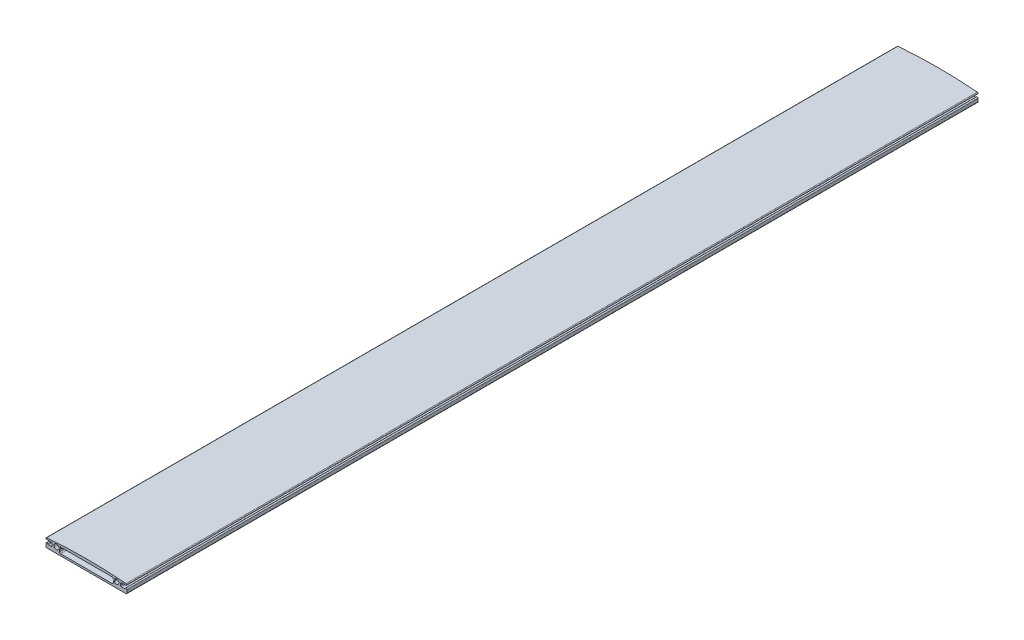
ISO-10303-21;
HEADER;
FILE_DESCRIPTION(('STEP AP214'),'2;1');
FILE_NAME('part.step','',(''),(''),'','','');
FILE_SCHEMA(('AUTOMOTIVE_DESIGN { 1 0 10303 214 1 1 1 1 }'));
ENDSEC;
DATA;
#1=APPLICATION_CONTEXT('core data for automotive mechanical design processes');
#2=APPLICATION_PROTOCOL_DEFINITION('international standard','automotive_design',2000,#1);
#3=PRODUCT_CONTEXT('',#1,'mechanical');
#4=PRODUCT('Part','Part','',(#3));
#5=PRODUCT_RELATED_PRODUCT_CATEGORY('part','',(#4));
#6=PRODUCT_DEFINITION_FORMATION('','',#4);
#7=PRODUCT_DEFINITION_CONTEXT('part definition',#1,'design');
#8=PRODUCT_DEFINITION('design','',#6,#7);
#9=PRODUCT_DEFINITION_SHAPE('','',#8);
#10=(LENGTH_UNIT() NAMED_UNIT(*) SI_UNIT(.MILLI.,.METRE.));
#11=(NAMED_UNIT(*) PLANE_ANGLE_UNIT() SI_UNIT($,.RADIAN.));
#12=(NAMED_UNIT(*) SI_UNIT($,.STERADIAN.) SOLID_ANGLE_UNIT());
#13=UNCERTAINTY_MEASURE_WITH_UNIT(LENGTH_MEASURE(1.E-05),#10,'distance_accuracy_value','');
#14=(GEOMETRIC_REPRESENTATION_CONTEXT(3) GLOBAL_UNCERTAINTY_ASSIGNED_CONTEXT((#13)) GLOBAL_UNIT_ASSIGNED_CONTEXT((#10,
#11,#12)) REPRESENTATION_CONTEXT('',''));
#15=CARTESIAN_POINT('',(0.,0.,0.));
#16=DIRECTION('',(0.,0.,1.));
#17=DIRECTION('',(1.,0.,0.));
#18=AXIS2_PLACEMENT_3D('',#15,#16,#17);
#19=CARTESIAN_POINT('',(24.4987244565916,-0.250000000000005,-347.75));
#20=DIRECTION('',(0.,0.,1.));
#21=DIRECTION('',(1.,0.,0.));
#22=AXIS2_PLACEMENT_3D('',#19,#20,#21);
#23=CYLINDRICAL_SURFACE('',#22,1.6);
#24=CARTESIAN_POINT('',(24.4987244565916,-0.250000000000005,-339.75));
#25=DIRECTION('',(0.,0.,-1.));
#26=DIRECTION('',(-1.,0.,0.));
#27=AXIS2_PLACEMENT_3D('',#24,#25,#26);
#28=CIRCLE('',#27,1.6);
#29=CARTESIAN_POINT('',(23.0853950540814,-1.,-339.75));
#30=VERTEX_POINT('',#29);
#31=CARTESIAN_POINT('',(23.0853950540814,0.499999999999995,-339.75));
#32=VERTEX_POINT('',#31);
#33=EDGE_CURVE('E628',#30,#32,#28,.F.);
#34=ORIENTED_EDGE('',*,*,#33,.F.);
#35=DIRECTION('',(0.,0.,1.));
#36=VECTOR('',#35,1.);
#37=CARTESIAN_POINT('',(23.0853950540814,-1.00000000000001,-347.75));
#38=LINE('',#37,#36);
#39=CARTESIAN_POINT('',(23.0853950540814,-1.00000000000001,337.619956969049));
#40=VERTEX_POINT('',#39);
#41=EDGE_CURVE('E345',#30,#40,#38,.T.);
#42=ORIENTED_EDGE('',*,*,#41,.T.);
#43=CARTESIAN_POINT('',(24.4987244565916,-0.250000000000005,337.619956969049));
#44=DIRECTION('',(0.,0.,1.));
#45=DIRECTION('',(1.,0.,0.));
#46=AXIS2_PLACEMENT_3D('',#43,#44,#45);
#47=CIRCLE('',#46,1.6);
#48=CARTESIAN_POINT('',(23.0853950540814,0.499999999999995,337.619956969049));
#49=VERTEX_POINT('',#48);
#50=EDGE_CURVE('E606',#40,#49,#47,.T.);
#51=ORIENTED_EDGE('',*,*,#50,.T.);
#52=DIRECTION('',(0.,0.,1.));
#53=VECTOR('',#52,1.);
#54=CARTESIAN_POINT('',(23.0853950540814,0.499999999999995,-347.75));
#55=LINE('',#54,#53);
#56=EDGE_CURVE('E358',#32,#49,#55,.T.);
#57=ORIENTED_EDGE('',*,*,#56,.F.);
#58=EDGE_LOOP('',(#34,#42,#51,#57));
#59=FACE_BOUND('',#58,.T.);
#60=ADVANCED_FACE('F16',(#59),#23,.F.);
#61=CARTESIAN_POINT('',(-24.4987244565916,-0.250000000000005,-347.75));
#62=DIRECTION('',(0.,0.,1.));
#63=DIRECTION('',(1.,0.,0.));
#64=AXIS2_PLACEMENT_3D('',#61,#62,#63);
#65=CYLINDRICAL_SURFACE('',#64,1.6);
#66=CARTESIAN_POINT('',(-24.4987244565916,-0.250000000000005,-339.75));
#67=DIRECTION('',(0.,0.,-1.));
#68=DIRECTION('',(-1.,0.,0.));
#69=AXIS2_PLACEMENT_3D('',#66,#67,#68);
#70=CIRCLE('',#69,1.6);
#71=CARTESIAN_POINT('',(-23.0853950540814,0.499999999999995,-339.75));
#72=VERTEX_POINT('',#71);
#73=CARTESIAN_POINT('',(-23.0853950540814,-1.,-339.75));
#74=VERTEX_POINT('',#73);
#75=EDGE_CURVE('E747',#72,#74,#70,.F.);
#76=ORIENTED_EDGE('',*,*,#75,.F.);
#77=DIRECTION('',(0.,0.,1.));
#78=VECTOR('',#77,1.);
#79=CARTESIAN_POINT('',(-23.0853950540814,0.499999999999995,-347.75));
#80=LINE('',#79,#78);
#81=CARTESIAN_POINT('',(-23.0853950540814,0.499999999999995,337.619956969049));
#82=VERTEX_POINT('',#81);
#83=EDGE_CURVE('E770',#72,#82,#80,.T.);
#84=ORIENTED_EDGE('',*,*,#83,.T.);
#85=CARTESIAN_POINT('',(-24.4987244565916,-0.250000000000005,337.619956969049));
#86=DIRECTION('',(0.,0.,1.));
#87=DIRECTION('',(1.,0.,0.));
#88=AXIS2_PLACEMENT_3D('',#85,#86,#87);
#89=CIRCLE('',#88,1.6);
#90=CARTESIAN_POINT('',(-23.0853950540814,-1.,337.619956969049));
#91=VERTEX_POINT('',#90);
#92=EDGE_CURVE('E652',#82,#91,#89,.T.);
#93=ORIENTED_EDGE('',*,*,#92,.T.);
#94=DIRECTION('',(0.,0.,1.));
#95=VECTOR('',#94,1.);
#96=CARTESIAN_POINT('',(-23.0853950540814,-1.,-347.75));
#97=LINE('',#96,#95);
#98=EDGE_CURVE('E768',#74,#91,#97,.T.);
#99=ORIENTED_EDGE('',*,*,#98,.F.);
#100=EDGE_LOOP('',(#76,#84,#93,#99));
#101=FACE_BOUND('',#100,.T.);
#102=ADVANCED_FACE('F618',(#101),#65,.F.);
#103=CARTESIAN_POINT('',(32.4,-4.4,347.75));
#104=DIRECTION('',(0.,0.,-1.));
#105=DIRECTION('',(-1.,0.,0.));
#106=AXIS2_PLACEMENT_3D('',#103,#104,#105);
#107=PLANE('',#106);
#108=DIRECTION('',(1.,0.,0.));
#109=VECTOR('',#108,1.);
#110=CARTESIAN_POINT('',(-22.,-5.,347.75));
#111=LINE('',#110,#109);
#112=CARTESIAN_POINT('',(-32.4,-5.,347.75));
#113=VERTEX_POINT('',#112);
#114=CARTESIAN_POINT('',(32.4,-5.00000000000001,347.75));
#115=VERTEX_POINT('',#114);
#116=EDGE_CURVE('E415',#113,#115,#111,.T.);
#117=ORIENTED_EDGE('',*,*,#116,.T.);
#118=CARTESIAN_POINT('',(32.4,-4.4,347.75));
#119=DIRECTION('',(0.,0.,1.));
#120=DIRECTION('',(-1.,0.,0.));
#121=AXIS2_PLACEMENT_3D('',#118,#119,#120);
#122=CIRCLE('',#121,0.600000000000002);
#123=CARTESIAN_POINT('',(33.,-4.4,347.75));
#124=VERTEX_POINT('',#123);
#125=EDGE_CURVE('E417',#115,#124,#122,.T.);
#126=ORIENTED_EDGE('',*,*,#125,.T.);
#127=DIRECTION('',(0.,1.,0.));
#128=VECTOR('',#127,1.);
#129=CARTESIAN_POINT('',(33.,-4.4,347.75));
#130=LINE('',#129,#128);
#131=CARTESIAN_POINT('',(33.,-2.,347.75));
#132=VERTEX_POINT('',#131);
#133=EDGE_CURVE('E420',#124,#132,#130,.T.);
#134=ORIENTED_EDGE('',*,*,#133,.T.);
#135=CARTESIAN_POINT('',(32.25,-2.,347.75));
#136=DIRECTION('',(0.,0.,1.));
#137=DIRECTION('',(-1.,0.,0.));
#138=AXIS2_PLACEMENT_3D('',#135,#136,#137);
#139=CIRCLE('',#138,0.75);
#140=CARTESIAN_POINT('',(31.5626136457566,-1.7,347.75));
#141=VERTEX_POINT('',#140);
#142=EDGE_CURVE('E422',#132,#141,#139,.T.);
#143=ORIENTED_EDGE('',*,*,#142,.T.);
#144=CARTESIAN_POINT('',(31.104356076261,-1.5,347.75));
#145=DIRECTION('',(0.,0.,-1.));
#146=DIRECTION('',(-1.,0.,0.));
#147=AXIS2_PLACEMENT_3D('',#144,#145,#146);
#148=CIRCLE('',#147,0.500000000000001);
#149=CARTESIAN_POINT('',(31.104356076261,-2.,347.75));
#150=VERTEX_POINT('',#149);
#151=EDGE_CURVE('E424',#141,#150,#148,.T.);
#152=ORIENTED_EDGE('',*,*,#151,.T.);
#153=DIRECTION('',(-1.,0.,0.));
#154=VECTOR('',#153,1.);
#155=CARTESIAN_POINT('',(31.104356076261,-2.,347.75));
#156=LINE('',#155,#154);
#157=CARTESIAN_POINT('',(28.6,-2.,347.75));
#158=VERTEX_POINT('',#157);
#159=EDGE_CURVE('E426',#150,#158,#156,.T.);
#160=ORIENTED_EDGE('',*,*,#159,.T.);
#161=CARTESIAN_POINT('',(28.6,-1.4,347.75));
#162=DIRECTION('',(0.,0.,-1.));
#163=DIRECTION('',(1.,0.,0.));
#164=AXIS2_PLACEMENT_3D('',#161,#162,#163);
#165=CIRCLE('',#164,0.6);
#166=CARTESIAN_POINT('',(28.,-1.4,347.75));
#167=VERTEX_POINT('',#166);
#168=EDGE_CURVE('E428',#158,#167,#165,.T.);
#169=ORIENTED_EDGE('',*,*,#168,.T.);
#170=DIRECTION('',(0.,1.,0.));
#171=VECTOR('',#170,1.);
#172=CARTESIAN_POINT('',(28.,0.149999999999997,347.75));
#173=LINE('',#172,#171);
#174=CARTESIAN_POINT('',(28.,0.149999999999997,347.75));
#175=VERTEX_POINT('',#174);
#176=EDGE_CURVE('E430',#167,#175,#173,.T.);
#177=ORIENTED_EDGE('',*,*,#176,.T.);
#178=CARTESIAN_POINT('',(28.85,0.149999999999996,347.75));
#179=DIRECTION('',(0.,0.,-1.));
#180=DIRECTION('',(-1.,0.,0.));
#181=AXIS2_PLACEMENT_3D('',#178,#179,#180);
#182=CIRCLE('',#181,0.850000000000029);
#183=CARTESIAN_POINT('',(28.85,0.999999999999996,347.75));
#184=VERTEX_POINT('',#183);
#185=EDGE_CURVE('E432',#175,#184,#182,.T.);
#186=ORIENTED_EDGE('',*,*,#185,.T.);
#187=DIRECTION('',(1.,0.,0.));
#188=VECTOR('',#187,1.);
#189=CARTESIAN_POINT('',(32.3999999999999,0.999999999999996,347.75));
#190=LINE('',#189,#188);
#191=CARTESIAN_POINT('',(32.3999999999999,0.999999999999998,347.75));
#192=VERTEX_POINT('',#191);
#193=EDGE_CURVE('E434',#184,#192,#190,.T.);
#194=ORIENTED_EDGE('',*,*,#193,.T.);
#195=CARTESIAN_POINT('',(32.4,1.60048941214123,347.75));
#196=DIRECTION('',(0.,0.,1.));
#197=DIRECTION('',(1.,0.,0.));
#198=AXIS2_PLACEMENT_3D('',#195,#196,#197);
#199=CIRCLE('',#198,0.600489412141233);
#200=CARTESIAN_POINT('',(32.4484386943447,2.19902197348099,347.75));
#201=VERTEX_POINT('',#200);
#202=EDGE_CURVE('E436',#192,#201,#199,.T.);
#203=ORIENTED_EDGE('',*,*,#202,.T.);
#204=CARTESIAN_POINT('',(0.,-398.75,347.75));
#205=DIRECTION('',(0.,0.,1.));
#206=DIRECTION('',(-1.,0.,0.));
#207=AXIS2_PLACEMENT_3D('',#204,#205,#206);
#208=CIRCLE('',#207,402.259890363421);
#209=CARTESIAN_POINT('',(-32.4484386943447,2.19902197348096,347.75));
#210=VERTEX_POINT('',#209);
#211=EDGE_CURVE('E438',#201,#210,#208,.T.);
#212=ORIENTED_EDGE('',*,*,#211,.T.);
#213=CARTESIAN_POINT('',(-32.4,1.60048941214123,347.75));
#214=DIRECTION('',(0.,0.,1.));
#215=DIRECTION('',(-1.,0.,0.));
#216=AXIS2_PLACEMENT_3D('',#213,#214,#215);
#217=CIRCLE('',#216,0.600489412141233);
#218=CARTESIAN_POINT('',(-32.3999999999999,0.999999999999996,347.75));
#219=VERTEX_POINT('',#218);
#220=EDGE_CURVE('E440',#210,#219,#217,.T.);
#221=ORIENTED_EDGE('',*,*,#220,.T.);
#222=DIRECTION('',(1.,0.,0.));
#223=VECTOR('',#222,1.);
#224=CARTESIAN_POINT('',(-32.3999999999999,0.999999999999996,347.75));
#225=LINE('',#224,#223);
#226=CARTESIAN_POINT('',(-28.85,1.00000000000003,347.75));
#227=VERTEX_POINT('',#226);
#228=EDGE_CURVE('E442',#219,#227,#225,.T.);
#229=ORIENTED_EDGE('',*,*,#228,.T.);
#230=CARTESIAN_POINT('',(-28.85,0.149999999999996,347.75));
#231=DIRECTION('',(0.,0.,-1.));
#232=DIRECTION('',(1.,0.,0.));
#233=AXIS2_PLACEMENT_3D('',#230,#231,#232);
#234=CIRCLE('',#233,0.850000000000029);
#235=CARTESIAN_POINT('',(-28.,0.149999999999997,347.75));
#236=VERTEX_POINT('',#235);
#237=EDGE_CURVE('E444',#227,#236,#234,.T.);
#238=ORIENTED_EDGE('',*,*,#237,.T.);
#239=DIRECTION('',(0.,-1.,0.));
#240=VECTOR('',#239,1.);
#241=CARTESIAN_POINT('',(-28.,0.149999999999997,347.75));
#242=LINE('',#241,#240);
#243=CARTESIAN_POINT('',(-28.,-1.4,347.75));
#244=VERTEX_POINT('',#243);
#245=EDGE_CURVE('E446',#236,#244,#242,.T.);
#246=ORIENTED_EDGE('',*,*,#245,.T.);
#247=CARTESIAN_POINT('',(-28.6,-1.4,347.75));
#248=DIRECTION('',(0.,0.,-1.));
#249=DIRECTION('',(-1.,0.,0.));
#250=AXIS2_PLACEMENT_3D('',#247,#248,#249);
#251=CIRCLE('',#250,0.6);
#252=CARTESIAN_POINT('',(-28.6,-2.,347.75));
#253=VERTEX_POINT('',#252);
#254=EDGE_CURVE('E448',#244,#253,#251,.T.);
#255=ORIENTED_EDGE('',*,*,#254,.T.);
#256=DIRECTION('',(-1.,0.,0.));
#257=VECTOR('',#256,1.);
#258=CARTESIAN_POINT('',(-31.104356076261,-2.,347.75));
#259=LINE('',#258,#257);
#260=CARTESIAN_POINT('',(-31.104356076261,-2.,347.75));
#261=VERTEX_POINT('',#260);
#262=EDGE_CURVE('E450',#253,#261,#259,.T.);
#263=ORIENTED_EDGE('',*,*,#262,.T.);
#264=CARTESIAN_POINT('',(-31.104356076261,-1.5,347.75));
#265=DIRECTION('',(0.,0.,-1.));
#266=DIRECTION('',(1.,0.,0.));
#267=AXIS2_PLACEMENT_3D('',#264,#265,#266);
#268=CIRCLE('',#267,0.500000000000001);
#269=CARTESIAN_POINT('',(-31.5626136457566,-1.7,347.75));
#270=VERTEX_POINT('',#269);
#271=EDGE_CURVE('E452',#261,#270,#268,.T.);
#272=ORIENTED_EDGE('',*,*,#271,.T.);
#273=CARTESIAN_POINT('',(-32.25,-2.,347.75));
#274=DIRECTION('',(0.,0.,1.));
#275=DIRECTION('',(1.,0.,0.));
#276=AXIS2_PLACEMENT_3D('',#273,#274,#275);
#277=CIRCLE('',#276,0.75);
#278=CARTESIAN_POINT('',(-33.,-2.,347.75));
#279=VERTEX_POINT('',#278);
#280=EDGE_CURVE('E454',#270,#279,#277,.T.);
#281=ORIENTED_EDGE('',*,*,#280,.T.);
#282=DIRECTION('',(0.,-1.,0.));
#283=VECTOR('',#282,1.);
#284=CARTESIAN_POINT('',(-33.,-4.4,347.75));
#285=LINE('',#284,#283);
#286=CARTESIAN_POINT('',(-33.,-4.4,347.75));
#287=VERTEX_POINT('',#286);
#288=EDGE_CURVE('E456',#279,#287,#285,.T.);
#289=ORIENTED_EDGE('',*,*,#288,.T.);
#290=CARTESIAN_POINT('',(-32.4,-4.4,347.75));
#291=DIRECTION('',(0.,0.,1.));
#292=DIRECTION('',(1.,0.,0.));
#293=AXIS2_PLACEMENT_3D('',#290,#291,#292);
#294=CIRCLE('',#293,0.600000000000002);
#295=EDGE_CURVE('E458',#287,#113,#294,.T.);
#296=ORIENTED_EDGE('',*,*,#295,.T.);
#297=EDGE_LOOP('',(#117,#126,#134,#143,#152,#160,#169,#177,#186,#194,#203,#212,#221,#229,#238,
#246,#255,#263,#272,#281,#289,#296));
#298=FACE_BOUND('',#297,.T.);
#299=CARTESIAN_POINT('',(-24.4987244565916,-0.250000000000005,347.75));
#300=DIRECTION('',(0.,0.,1.));
#301=DIRECTION('',(1.,0.,0.));
#302=AXIS2_PLACEMENT_3D('',#299,#300,#301);
#303=CIRCLE('',#302,1.99999999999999);
#304=CARTESIAN_POINT('',(-22.6446748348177,0.499999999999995,347.75));
#305=VERTEX_POINT('',#304);
#306=CARTESIAN_POINT('',(-22.6446748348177,-1.,347.75));
#307=VERTEX_POINT('',#306);
#308=EDGE_CURVE('E765',#305,#307,#303,.T.);
#309=ORIENTED_EDGE('',*,*,#308,.F.);
#310=DIRECTION('',(-1.,0.,0.));
#311=VECTOR('',#310,1.);
#312=CARTESIAN_POINT('',(-23.0853950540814,0.499999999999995,347.75));
#313=LINE('',#312,#311);
#314=CARTESIAN_POINT('',(-21.9682458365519,0.499999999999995,347.75));
#315=VERTEX_POINT('',#314);
#316=EDGE_CURVE('E605',#315,#305,#313,.T.);
#317=ORIENTED_EDGE('',*,*,#316,.F.);
#318=CARTESIAN_POINT('',(-21.,0.249999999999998,347.75));
#319=DIRECTION('',(0.,0.,1.));
#320=DIRECTION('',(-1.,0.,0.));
#321=AXIS2_PLACEMENT_3D('',#318,#319,#320);
#322=CIRCLE('',#321,1.);
#323=CARTESIAN_POINT('',(-21.,1.25,347.75));
#324=VERTEX_POINT('',#323);
#325=EDGE_CURVE('E361',#324,#315,#322,.T.);
#326=ORIENTED_EDGE('',*,*,#325,.F.);
#327=DIRECTION('',(-1.,0.,0.));
#328=VECTOR('',#327,1.);
#329=CARTESIAN_POINT('',(-21.,1.25,347.75));
#330=LINE('',#329,#328);
#331=CARTESIAN_POINT('',(21.,1.25,347.75));
#332=VERTEX_POINT('',#331);
#333=EDGE_CURVE('E378',#332,#324,#330,.T.);
#334=ORIENTED_EDGE('',*,*,#333,.F.);
#335=CARTESIAN_POINT('',(21.,0.249999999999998,347.75));
#336=DIRECTION('',(0.,0.,1.));
#337=DIRECTION('',(1.,0.,0.));
#338=AXIS2_PLACEMENT_3D('',#335,#336,#337);
#339=CIRCLE('',#338,1.);
#340=CARTESIAN_POINT('',(21.9682458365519,0.499999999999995,347.75));
#341=VERTEX_POINT('',#340);
#342=EDGE_CURVE('E376',#341,#332,#339,.T.);
#343=ORIENTED_EDGE('',*,*,#342,.F.);
#344=DIRECTION('',(-1.,0.,0.));
#345=VECTOR('',#344,1.);
#346=CARTESIAN_POINT('',(23.0853950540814,0.499999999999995,347.75));
#347=LINE('',#346,#345);
#348=CARTESIAN_POINT('',(22.6446748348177,0.499999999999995,347.75));
#349=VERTEX_POINT('',#348);
#350=EDGE_CURVE('E347',#349,#341,#347,.T.);
#351=ORIENTED_EDGE('',*,*,#350,.F.);
#352=CARTESIAN_POINT('',(24.4987244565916,-0.250000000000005,347.75));
#353=DIRECTION('',(0.,0.,1.));
#354=DIRECTION('',(1.,0.,0.));
#355=AXIS2_PLACEMENT_3D('',#352,#353,#354);
#356=CIRCLE('',#355,1.99999999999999);
#357=CARTESIAN_POINT('',(22.6446748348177,-1.,347.75));
#358=VERTEX_POINT('',#357);
#359=EDGE_CURVE('E662',#358,#349,#356,.T.);
#360=ORIENTED_EDGE('',*,*,#359,.F.);
#361=DIRECTION('',(1.,0.,0.));
#362=VECTOR('',#361,1.);
#363=CARTESIAN_POINT('',(23.0853950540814,-1.,347.75));
#364=LINE('',#363,#362);
#365=CARTESIAN_POINT('',(22.,-1.,347.75));
#366=VERTEX_POINT('',#365);
#367=EDGE_CURVE('E351',#366,#358,#364,.T.);
#368=ORIENTED_EDGE('',*,*,#367,.F.);
#369=DIRECTION('',(0.,1.,0.));
#370=VECTOR('',#369,1.);
#371=CARTESIAN_POINT('',(22.,-2.5,347.75));
#372=LINE('',#371,#370);
#373=CARTESIAN_POINT('',(22.,-2.5,347.75));
#374=VERTEX_POINT('',#373);
#375=EDGE_CURVE('E373',#374,#366,#372,.T.);
#376=ORIENTED_EDGE('',*,*,#375,.F.);
#377=CARTESIAN_POINT('',(21.,-2.5,347.75));
#378=DIRECTION('',(0.,0.,1.));
#379=DIRECTION('',(-1.,0.,0.));
#380=AXIS2_PLACEMENT_3D('',#377,#378,#379);
#381=CIRCLE('',#380,1.);
#382=CARTESIAN_POINT('',(21.,-3.5,347.75));
#383=VERTEX_POINT('',#382);
#384=EDGE_CURVE('E371',#383,#374,#381,.T.);
#385=ORIENTED_EDGE('',*,*,#384,.F.);
#386=DIRECTION('',(1.,0.,0.));
#387=VECTOR('',#386,1.);
#388=CARTESIAN_POINT('',(21.,-3.5,347.75));
#389=LINE('',#388,#387);
#390=CARTESIAN_POINT('',(-21.,-3.50000000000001,347.75));
#391=VERTEX_POINT('',#390);
#392=EDGE_CURVE('E369',#391,#383,#389,.T.);
#393=ORIENTED_EDGE('',*,*,#392,.F.);
#394=CARTESIAN_POINT('',(-21.,-2.50000000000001,347.75));
#395=DIRECTION('',(0.,0.,1.));
#396=DIRECTION('',(-1.,0.,0.));
#397=AXIS2_PLACEMENT_3D('',#394,#395,#396);
#398=CIRCLE('',#397,1.);
#399=CARTESIAN_POINT('',(-22.,-2.50000000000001,347.75));
#400=VERTEX_POINT('',#399);
#401=EDGE_CURVE('E367',#400,#391,#398,.T.);
#402=ORIENTED_EDGE('',*,*,#401,.F.);
#403=DIRECTION('',(0.,-1.,0.));
#404=VECTOR('',#403,1.);
#405=CARTESIAN_POINT('',(-22.,-2.50000000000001,347.75));
#406=LINE('',#405,#404);
#407=CARTESIAN_POINT('',(-22.,-1.,347.75));
#408=VERTEX_POINT('',#407);
#409=EDGE_CURVE('E364',#408,#400,#406,.T.);
#410=ORIENTED_EDGE('',*,*,#409,.F.);
#411=DIRECTION('',(1.,0.,0.));
#412=VECTOR('',#411,1.);
#413=CARTESIAN_POINT('',(-23.0853950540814,-1.,347.75));
#414=LINE('',#413,#412);
#415=EDGE_CURVE('E779',#307,#408,#414,.T.);
#416=ORIENTED_EDGE('',*,*,#415,.F.);
#417=EDGE_LOOP('',(#309,#317,#326,#334,#343,#351,#360,#368,#376,#385,#393,#402,#410,#416));
#418=FACE_BOUND('',#417,.T.);
#419=ADVANCED_FACE('F624',(#298,#418),#107,.F.);
#420=CARTESIAN_POINT('',(32.4,-4.4,-347.75));
#421=DIRECTION('',(0.,0.,-1.));
#422=DIRECTION('',(-1.,0.,0.));
#423=AXIS2_PLACEMENT_3D('',#420,#421,#422);
#424=PLANE('',#423);
#425=CARTESIAN_POINT('',(24.4987244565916,-0.250000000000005,-347.75));
#426=DIRECTION('',(0.,0.,-1.));
#427=DIRECTION('',(-1.,0.,0.));
#428=AXIS2_PLACEMENT_3D('',#425,#426,#427);
#429=CIRCLE('',#428,2.);
#430=CARTESIAN_POINT('',(22.6446748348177,0.499999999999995,-347.75));
#431=VERTEX_POINT('',#430);
#432=CARTESIAN_POINT('',(22.6446748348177,-1.,-347.75));
#433=VERTEX_POINT('',#432);
#434=EDGE_CURVE('E323',#431,#433,#429,.T.);
#435=ORIENTED_EDGE('',*,*,#434,.F.);
#436=DIRECTION('',(-1.,0.,0.));
#437=VECTOR('',#436,1.);
#438=CARTESIAN_POINT('',(23.0853950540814,0.499999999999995,-347.75));
#439=LINE('',#438,#437);
#440=CARTESIAN_POINT('',(21.9682458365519,0.499999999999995,-347.75));
#441=VERTEX_POINT('',#440);
#442=EDGE_CURVE('E334',#431,#441,#439,.T.);
#443=ORIENTED_EDGE('',*,*,#442,.T.);
#444=CARTESIAN_POINT('',(21.,0.249999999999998,-347.75));
#445=DIRECTION('',(0.,0.,1.));
#446=DIRECTION('',(1.,0.,0.));
#447=AXIS2_PLACEMENT_3D('',#444,#445,#446);
#448=CIRCLE('',#447,1.);
#449=CARTESIAN_POINT('',(21.,1.25,-347.75));
#450=VERTEX_POINT('',#449);
#451=EDGE_CURVE('E396',#441,#450,#448,.T.);
#452=ORIENTED_EDGE('',*,*,#451,.T.);
#453=DIRECTION('',(-1.,0.,0.));
#454=VECTOR('',#453,1.);
#455=CARTESIAN_POINT('',(-21.,1.25,-347.75));
#456=LINE('',#455,#454);
#457=CARTESIAN_POINT('',(-21.,1.25,-347.75));
#458=VERTEX_POINT('',#457);
#459=EDGE_CURVE('E365',#450,#458,#456,.T.);
#460=ORIENTED_EDGE('',*,*,#459,.T.);
#461=CARTESIAN_POINT('',(-21.,0.249999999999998,-347.75));
#462=DIRECTION('',(0.,0.,1.));
#463=DIRECTION('',(-1.,0.,0.));
#464=AXIS2_PLACEMENT_3D('',#461,#462,#463);
#465=CIRCLE('',#464,1.);
#466=CARTESIAN_POINT('',(-21.9682458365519,0.499999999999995,-347.75));
#467=VERTEX_POINT('',#466);
#468=EDGE_CURVE('E357',#458,#467,#465,.T.);
#469=ORIENTED_EDGE('',*,*,#468,.T.);
#470=DIRECTION('',(-1.,0.,0.));
#471=VECTOR('',#470,1.);
#472=CARTESIAN_POINT('',(-23.0853950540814,0.499999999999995,-347.75));
#473=LINE('',#472,#471);
#474=CARTESIAN_POINT('',(-22.6446748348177,0.499999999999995,-347.75));
#475=VERTEX_POINT('',#474);
#476=EDGE_CURVE('E608',#467,#475,#473,.T.);
#477=ORIENTED_EDGE('',*,*,#476,.T.);
#478=CARTESIAN_POINT('',(-24.4987244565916,-0.250000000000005,-347.75));
#479=DIRECTION('',(0.,0.,-1.));
#480=DIRECTION('',(-1.,0.,0.));
#481=AXIS2_PLACEMENT_3D('',#478,#479,#480);
#482=CIRCLE('',#481,2.);
#483=CARTESIAN_POINT('',(-22.6446748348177,-1.,-347.75));
#484=VERTEX_POINT('',#483);
#485=EDGE_CURVE('E327',#484,#475,#482,.T.);
#486=ORIENTED_EDGE('',*,*,#485,.F.);
#487=DIRECTION('',(1.,0.,0.));
#488=VECTOR('',#487,1.);
#489=CARTESIAN_POINT('',(-23.0853950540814,-1.,-347.75));
#490=LINE('',#489,#488);
#491=CARTESIAN_POINT('',(-22.,-1.,-347.75));
#492=VERTEX_POINT('',#491);
#493=EDGE_CURVE('E758',#484,#492,#490,.T.);
#494=ORIENTED_EDGE('',*,*,#493,.T.);
#495=DIRECTION('',(0.,-1.,0.));
#496=VECTOR('',#495,1.);
#497=CARTESIAN_POINT('',(-22.,-2.50000000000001,-347.75));
#498=LINE('',#497,#496);
#499=CARTESIAN_POINT('',(-22.,-2.50000000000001,-347.75));
#500=VERTEX_POINT('',#499);
#501=EDGE_CURVE('E383',#492,#500,#498,.T.);
#502=ORIENTED_EDGE('',*,*,#501,.T.);
#503=CARTESIAN_POINT('',(-21.,-2.50000000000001,-347.75));
#504=DIRECTION('',(0.,0.,1.));
#505=DIRECTION('',(-1.,0.,0.));
#506=AXIS2_PLACEMENT_3D('',#503,#504,#505);
#507=CIRCLE('',#506,1.);
#508=CARTESIAN_POINT('',(-21.,-3.50000000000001,-347.75));
#509=VERTEX_POINT('',#508);
#510=EDGE_CURVE('E385',#500,#509,#507,.T.);
#511=ORIENTED_EDGE('',*,*,#510,.T.);
#512=DIRECTION('',(1.,0.,0.));
#513=VECTOR('',#512,1.);
#514=CARTESIAN_POINT('',(21.,-3.5,-347.75));
#515=LINE('',#514,#513);
#516=CARTESIAN_POINT('',(21.,-3.5,-347.75));
#517=VERTEX_POINT('',#516);
#518=EDGE_CURVE('E388',#509,#517,#515,.T.);
#519=ORIENTED_EDGE('',*,*,#518,.T.);
#520=CARTESIAN_POINT('',(21.,-2.5,-347.75));
#521=DIRECTION('',(0.,0.,1.));
#522=DIRECTION('',(-1.,0.,0.));
#523=AXIS2_PLACEMENT_3D('',#520,#521,#522);
#524=CIRCLE('',#523,1.);
#525=CARTESIAN_POINT('',(22.,-2.5,-347.75));
#526=VERTEX_POINT('',#525);
#527=EDGE_CURVE('E391',#517,#526,#524,.T.);
#528=ORIENTED_EDGE('',*,*,#527,.T.);
#529=DIRECTION('',(0.,1.,0.));
#530=VECTOR('',#529,1.);
#531=CARTESIAN_POINT('',(22.,-2.5,-347.75));
#532=LINE('',#531,#530);
#533=CARTESIAN_POINT('',(22.,-1.,-347.75));
#534=VERTEX_POINT('',#533);
#535=EDGE_CURVE('E394',#526,#534,#532,.T.);
#536=ORIENTED_EDGE('',*,*,#535,.T.);
#537=DIRECTION('',(1.,0.,0.));
#538=VECTOR('',#537,1.);
#539=CARTESIAN_POINT('',(23.0853950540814,-1.,-347.75));
#540=LINE('',#539,#538);
#541=EDGE_CURVE('E337',#534,#433,#540,.T.);
#542=ORIENTED_EDGE('',*,*,#541,.T.);
#543=EDGE_LOOP('',(#435,#443,#452,#460,#469,#477,#486,#494,#502,#511,#519,#528,#536,#542));
#544=FACE_BOUND('',#543,.T.);
#545=CARTESIAN_POINT('',(32.4,-4.4,-347.75));
#546=DIRECTION('',(0.,0.,1.));
#547=DIRECTION('',(-1.,0.,0.));
#548=AXIS2_PLACEMENT_3D('',#545,#546,#547);
#549=CIRCLE('',#548,0.600000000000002);
#550=CARTESIAN_POINT('',(32.4,-5.00000000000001,-347.75));
#551=VERTEX_POINT('',#550);
#552=CARTESIAN_POINT('',(33.,-4.4,-347.75));
#553=VERTEX_POINT('',#552);
#554=EDGE_CURVE('E414',#551,#553,#549,.T.);
#555=ORIENTED_EDGE('',*,*,#554,.F.);
#556=DIRECTION('',(1.,0.,0.));
#557=VECTOR('',#556,1.);
#558=CARTESIAN_POINT('',(-22.,-5.,-347.75));
#559=LINE('',#558,#557);
#560=CARTESIAN_POINT('',(-32.4,-5.,-347.75));
#561=VERTEX_POINT('',#560);
#562=EDGE_CURVE('E418',#561,#551,#559,.T.);
#563=ORIENTED_EDGE('',*,*,#562,.F.);
#564=CARTESIAN_POINT('',(-32.4,-4.4,-347.75));
#565=DIRECTION('',(0.,0.,1.));
#566=DIRECTION('',(1.,0.,0.));
#567=AXIS2_PLACEMENT_3D('',#564,#565,#566);
#568=CIRCLE('',#567,0.600000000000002);
#569=CARTESIAN_POINT('',(-33.,-4.4,-347.75));
#570=VERTEX_POINT('',#569);
#571=EDGE_CURVE('E501',#570,#561,#568,.T.);
#572=ORIENTED_EDGE('',*,*,#571,.F.);
#573=DIRECTION('',(0.,-1.,0.));
#574=VECTOR('',#573,1.);
#575=CARTESIAN_POINT('',(-33.,-4.4,-347.75));
#576=LINE('',#575,#574);
#577=CARTESIAN_POINT('',(-33.,-2.,-347.75));
#578=VERTEX_POINT('',#577);
#579=EDGE_CURVE('E499',#578,#570,#576,.T.);
#580=ORIENTED_EDGE('',*,*,#579,.F.);
#581=CARTESIAN_POINT('',(-32.25,-2.,-347.75));
#582=DIRECTION('',(0.,0.,1.));
#583=DIRECTION('',(1.,0.,0.));
#584=AXIS2_PLACEMENT_3D('',#581,#582,#583);
#585=CIRCLE('',#584,0.75);
#586=CARTESIAN_POINT('',(-31.5626136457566,-1.7,-347.75));
#587=VERTEX_POINT('',#586);
#588=EDGE_CURVE('E497',#587,#578,#585,.T.);
#589=ORIENTED_EDGE('',*,*,#588,.F.);
#590=CARTESIAN_POINT('',(-31.104356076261,-1.5,-347.75));
#591=DIRECTION('',(0.,0.,-1.));
#592=DIRECTION('',(1.,0.,0.));
#593=AXIS2_PLACEMENT_3D('',#590,#591,#592);
#594=CIRCLE('',#593,0.500000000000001);
#595=CARTESIAN_POINT('',(-31.104356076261,-2.,-347.75));
#596=VERTEX_POINT('',#595);
#597=EDGE_CURVE('E495',#596,#587,#594,.T.);
#598=ORIENTED_EDGE('',*,*,#597,.F.);
#599=DIRECTION('',(-1.,0.,0.));
#600=VECTOR('',#599,1.);
#601=CARTESIAN_POINT('',(-31.104356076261,-2.,-347.75));
#602=LINE('',#601,#600);
#603=CARTESIAN_POINT('',(-28.6,-2.,-347.75));
#604=VERTEX_POINT('',#603);
#605=EDGE_CURVE('E493',#604,#596,#602,.T.);
#606=ORIENTED_EDGE('',*,*,#605,.F.);
#607=CARTESIAN_POINT('',(-28.6,-1.4,-347.75));
#608=DIRECTION('',(0.,0.,-1.));
#609=DIRECTION('',(-1.,0.,0.));
#610=AXIS2_PLACEMENT_3D('',#607,#608,#609);
#611=CIRCLE('',#610,0.6);
#612=CARTESIAN_POINT('',(-28.,-1.4,-347.75));
#613=VERTEX_POINT('',#612);
#614=EDGE_CURVE('E491',#613,#604,#611,.T.);
#615=ORIENTED_EDGE('',*,*,#614,.F.);
#616=DIRECTION('',(0.,-1.,0.));
#617=VECTOR('',#616,1.);
#618=CARTESIAN_POINT('',(-28.,0.149999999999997,-347.75));
#619=LINE('',#618,#617);
#620=CARTESIAN_POINT('',(-28.,0.149999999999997,-347.75));
#621=VERTEX_POINT('',#620);
#622=EDGE_CURVE('E489',#621,#613,#619,.T.);
#623=ORIENTED_EDGE('',*,*,#622,.F.);
#624=CARTESIAN_POINT('',(-28.85,0.149999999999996,-347.75));
#625=DIRECTION('',(0.,0.,-1.));
#626=DIRECTION('',(1.,0.,0.));
#627=AXIS2_PLACEMENT_3D('',#624,#625,#626);
#628=CIRCLE('',#627,0.850000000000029);
#629=CARTESIAN_POINT('',(-28.85,1.00000000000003,-347.75));
#630=VERTEX_POINT('',#629);
#631=EDGE_CURVE('E487',#630,#621,#628,.T.);
#632=ORIENTED_EDGE('',*,*,#631,.F.);
#633=DIRECTION('',(1.,0.,0.));
#634=VECTOR('',#633,1.);
#635=CARTESIAN_POINT('',(-32.3999999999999,0.999999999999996,-347.75));
#636=LINE('',#635,#634);
#637=CARTESIAN_POINT('',(-32.3999999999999,0.999999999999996,-347.75));
#638=VERTEX_POINT('',#637);
#639=EDGE_CURVE('E485',#638,#630,#636,.T.);
#640=ORIENTED_EDGE('',*,*,#639,.F.);
#641=CARTESIAN_POINT('',(-32.4,1.60048941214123,-347.75));
#642=DIRECTION('',(0.,0.,1.));
#643=DIRECTION('',(-1.,0.,0.));
#644=AXIS2_PLACEMENT_3D('',#641,#642,#643);
#645=CIRCLE('',#644,0.600489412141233);
#646=CARTESIAN_POINT('',(-32.4484386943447,2.19902197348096,-347.75));
#647=VERTEX_POINT('',#646);
#648=EDGE_CURVE('E483',#647,#638,#645,.T.);
#649=ORIENTED_EDGE('',*,*,#648,.F.);
#650=CARTESIAN_POINT('',(0.,-398.75,-347.75));
#651=DIRECTION('',(0.,0.,1.));
#652=DIRECTION('',(-1.,0.,0.));
#653=AXIS2_PLACEMENT_3D('',#650,#651,#652);
#654=CIRCLE('',#653,402.259890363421);
#655=CARTESIAN_POINT('',(32.4484386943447,2.19902197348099,-347.75));
#656=VERTEX_POINT('',#655);
#657=EDGE_CURVE('E481',#656,#647,#654,.T.);
#658=ORIENTED_EDGE('',*,*,#657,.F.);
#659=CARTESIAN_POINT('',(32.4,1.60048941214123,-347.75));
#660=DIRECTION('',(0.,0.,1.));
#661=DIRECTION('',(1.,0.,0.));
#662=AXIS2_PLACEMENT_3D('',#659,#660,#661);
#663=CIRCLE('',#662,0.600489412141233);
#664=CARTESIAN_POINT('',(32.3999999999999,0.999999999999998,-347.75));
#665=VERTEX_POINT('',#664);
#666=EDGE_CURVE('E479',#665,#656,#663,.T.);
#667=ORIENTED_EDGE('',*,*,#666,.F.);
#668=DIRECTION('',(1.,0.,0.));
#669=VECTOR('',#668,1.);
#670=CARTESIAN_POINT('',(32.3999999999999,0.999999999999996,-347.75));
#671=LINE('',#670,#669);
#672=CARTESIAN_POINT('',(28.85,0.999999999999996,-347.75));
#673=VERTEX_POINT('',#672);
#674=EDGE_CURVE('E477',#673,#665,#671,.T.);
#675=ORIENTED_EDGE('',*,*,#674,.F.);
#676=CARTESIAN_POINT('',(28.85,0.149999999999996,-347.75));
#677=DIRECTION('',(0.,0.,-1.));
#678=DIRECTION('',(-1.,0.,0.));
#679=AXIS2_PLACEMENT_3D('',#676,#677,#678);
#680=CIRCLE('',#679,0.850000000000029);
#681=CARTESIAN_POINT('',(28.,0.149999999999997,-347.75));
#682=VERTEX_POINT('',#681);
#683=EDGE_CURVE('E475',#682,#673,#680,.T.);
#684=ORIENTED_EDGE('',*,*,#683,.F.);
#685=DIRECTION('',(0.,1.,0.));
#686=VECTOR('',#685,1.);
#687=CARTESIAN_POINT('',(28.,0.149999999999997,-347.75));
#688=LINE('',#687,#686);
#689=CARTESIAN_POINT('',(28.,-1.4,-347.75));
#690=VERTEX_POINT('',#689);
#691=EDGE_CURVE('E473',#690,#682,#688,.T.);
#692=ORIENTED_EDGE('',*,*,#691,.F.);
#693=CARTESIAN_POINT('',(28.6,-1.4,-347.75));
#694=DIRECTION('',(0.,0.,-1.));
#695=DIRECTION('',(1.,0.,0.));
#696=AXIS2_PLACEMENT_3D('',#693,#694,#695);
#697=CIRCLE('',#696,0.6);
#698=CARTESIAN_POINT('',(28.6,-2.,-347.75));
#699=VERTEX_POINT('',#698);
#700=EDGE_CURVE('E471',#699,#690,#697,.T.);
#701=ORIENTED_EDGE('',*,*,#700,.F.);
#702=DIRECTION('',(-1.,0.,0.));
#703=VECTOR('',#702,1.);
#704=CARTESIAN_POINT('',(31.104356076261,-2.,-347.75));
#705=LINE('',#704,#703);
#706=CARTESIAN_POINT('',(31.104356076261,-2.,-347.75));
#707=VERTEX_POINT('',#706);
#708=EDGE_CURVE('E469',#707,#699,#705,.T.);
#709=ORIENTED_EDGE('',*,*,#708,.F.);
#710=CARTESIAN_POINT('',(31.104356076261,-1.5,-347.75));
#711=DIRECTION('',(0.,0.,-1.));
#712=DIRECTION('',(-1.,0.,0.));
#713=AXIS2_PLACEMENT_3D('',#710,#711,#712);
#714=CIRCLE('',#713,0.500000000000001);
#715=CARTESIAN_POINT('',(31.5626136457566,-1.7,-347.75));
#716=VERTEX_POINT('',#715);
#717=EDGE_CURVE('E467',#716,#707,#714,.T.);
#718=ORIENTED_EDGE('',*,*,#717,.F.);
#719=CARTESIAN_POINT('',(32.25,-2.,-347.75));
#720=DIRECTION('',(0.,0.,1.));
#721=DIRECTION('',(-1.,0.,0.));
#722=AXIS2_PLACEMENT_3D('',#719,#720,#721);
#723=CIRCLE('',#722,0.75);
#724=CARTESIAN_POINT('',(33.,-2.,-347.75));
#725=VERTEX_POINT('',#724);
#726=EDGE_CURVE('E465',#725,#716,#723,.T.);
#727=ORIENTED_EDGE('',*,*,#726,.F.);
#728=DIRECTION('',(0.,1.,0.));
#729=VECTOR('',#728,1.);
#730=CARTESIAN_POINT('',(33.,-4.4,-347.75));
#731=LINE('',#730,#729);
#732=EDGE_CURVE('E463',#553,#725,#731,.T.);
#733=ORIENTED_EDGE('',*,*,#732,.F.);
#734=EDGE_LOOP('',(#555,#563,#572,#580,#589,#598,#606,#615,#623,#632,#640,#649,#658,#667,#675,
#684,#692,#701,#709,#718,#727,#733));
#735=FACE_BOUND('',#734,.T.);
#736=ADVANCED_FACE('F332',(#544,#735),#424,.T.);
#737=CARTESIAN_POINT('',(32.4,-4.4,347.75));
#738=DIRECTION('',(0.,0.,-1.));
#739=DIRECTION('',(-1.,0.,0.));
#740=AXIS2_PLACEMENT_3D('',#737,#738,#739);
#741=CYLINDRICAL_SURFACE('',#740,0.600000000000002);
#742=ORIENTED_EDGE('',*,*,#554,.T.);
#743=DIRECTION('',(0.,0.,-1.));
#744=VECTOR('',#743,1.);
#745=CARTESIAN_POINT('',(33.,-4.4,347.75));
#746=LINE('',#745,#744);
#747=EDGE_CURVE('E563',#124,#553,#746,.T.);
#748=ORIENTED_EDGE('',*,*,#747,.F.);
#749=ORIENTED_EDGE('',*,*,#125,.F.);
#750=DIRECTION('',(0.,0.,-1.));
#751=VECTOR('',#750,1.);
#752=CARTESIAN_POINT('',(32.4,-5.00000000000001,347.75));
#753=LINE('',#752,#751);
#754=EDGE_CURVE('E566',#115,#551,#753,.T.);
#755=ORIENTED_EDGE('',*,*,#754,.T.);
#756=EDGE_LOOP('',(#742,#748,#749,#755));
#757=FACE_BOUND('',#756,.T.);
#758=ADVANCED_FACE('F18',(#757),#741,.T.);
#759=CARTESIAN_POINT('',(33.,-4.4,347.75));
#760=DIRECTION('',(-1.,0.,0.));
#761=DIRECTION('',(0.,-1.,0.));
#762=AXIS2_PLACEMENT_3D('',#759,#760,#761);
#763=PLANE('',#762);
#764=ORIENTED_EDGE('',*,*,#732,.T.);
#765=DIRECTION('',(0.,0.,-1.));
#766=VECTOR('',#765,1.);
#767=CARTESIAN_POINT('',(33.,-2.,347.75));
#768=LINE('',#767,#766);
#769=EDGE_CURVE('E560',#132,#725,#768,.T.);
#770=ORIENTED_EDGE('',*,*,#769,.F.);
#771=ORIENTED_EDGE('',*,*,#133,.F.);
#772=ORIENTED_EDGE('',*,*,#747,.T.);
#773=EDGE_LOOP('',(#764,#770,#771,#772));
#774=FACE_BOUND('',#773,.T.);
#775=ADVANCED_FACE('F926',(#774),#763,.F.);
#776=CARTESIAN_POINT('',(32.25,-2.,347.75));
#777=DIRECTION('',(0.,0.,-1.));
#778=DIRECTION('',(-1.,0.,0.));
#779=AXIS2_PLACEMENT_3D('',#776,#777,#778);
#780=CYLINDRICAL_SURFACE('',#779,0.75);
#781=ORIENTED_EDGE('',*,*,#726,.T.);
#782=DIRECTION('',(0.,0.,-1.));
#783=VECTOR('',#782,1.);
#784=CARTESIAN_POINT('',(31.5626136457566,-1.7,347.75));
#785=LINE('',#784,#783);
#786=EDGE_CURVE('E557',#141,#716,#785,.T.);
#787=ORIENTED_EDGE('',*,*,#786,.F.);
#788=ORIENTED_EDGE('',*,*,#142,.F.);
#789=ORIENTED_EDGE('',*,*,#769,.T.);
#790=EDGE_LOOP('',(#781,#787,#788,#789));
#791=FACE_BOUND('',#790,.T.);
#792=ADVANCED_FACE('F923',(#791),#780,.T.);
#793=CARTESIAN_POINT('',(31.104356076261,-1.5,347.75));
#794=DIRECTION('',(0.,0.,-1.));
#795=DIRECTION('',(-1.,0.,0.));
#796=AXIS2_PLACEMENT_3D('',#793,#794,#795);
#797=CYLINDRICAL_SURFACE('',#796,0.500000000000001);
#798=ORIENTED_EDGE('',*,*,#717,.T.);
#799=DIRECTION('',(0.,0.,-1.));
#800=VECTOR('',#799,1.);
#801=CARTESIAN_POINT('',(31.104356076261,-2.,347.75));
#802=LINE('',#801,#800);
#803=EDGE_CURVE('E554',#150,#707,#802,.T.);
#804=ORIENTED_EDGE('',*,*,#803,.F.);
#805=ORIENTED_EDGE('',*,*,#151,.F.);
#806=ORIENTED_EDGE('',*,*,#786,.T.);
#807=EDGE_LOOP('',(#798,#804,#805,#806));
#808=FACE_BOUND('',#807,.T.);
#809=ADVANCED_FACE('F919',(#808),#797,.F.);
#810=CARTESIAN_POINT('',(31.104356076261,-2.,347.75));
#811=DIRECTION('',(0.,-1.,0.));
#812=DIRECTION('',(1.,0.,0.));
#813=AXIS2_PLACEMENT_3D('',#810,#811,#812);
#814=PLANE('',#813);
#815=ORIENTED_EDGE('',*,*,#708,.T.);
#816=DIRECTION('',(0.,0.,-1.));
#817=VECTOR('',#816,1.);
#818=CARTESIAN_POINT('',(28.6,-2.,347.75));
#819=LINE('',#818,#817);
#820=EDGE_CURVE('E551',#158,#699,#819,.T.);
#821=ORIENTED_EDGE('',*,*,#820,.F.);
#822=ORIENTED_EDGE('',*,*,#159,.F.);
#823=ORIENTED_EDGE('',*,*,#803,.T.);
#824=EDGE_LOOP('',(#815,#821,#822,#823));
#825=FACE_BOUND('',#824,.T.);
#826=ADVANCED_FACE('F915',(#825),#814,.F.);
#827=CARTESIAN_POINT('',(28.6,-1.4,347.75));
#828=DIRECTION('',(0.,0.,-1.));
#829=DIRECTION('',(-1.,0.,0.));
#830=AXIS2_PLACEMENT_3D('',#827,#828,#829);
#831=CYLINDRICAL_SURFACE('',#830,0.6);
#832=ORIENTED_EDGE('',*,*,#700,.T.);
#833=DIRECTION('',(0.,0.,-1.));
#834=VECTOR('',#833,1.);
#835=CARTESIAN_POINT('',(28.,-1.4,347.75));
#836=LINE('',#835,#834);
#837=EDGE_CURVE('E548',#167,#690,#836,.T.);
#838=ORIENTED_EDGE('',*,*,#837,.F.);
#839=ORIENTED_EDGE('',*,*,#168,.F.);
#840=ORIENTED_EDGE('',*,*,#820,.T.);
#841=EDGE_LOOP('',(#832,#838,#839,#840));
#842=FACE_BOUND('',#841,.T.);
#843=ADVANCED_FACE('F911',(#842),#831,.F.);
#844=CARTESIAN_POINT('',(28.,0.149999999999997,347.75));
#845=DIRECTION('',(-1.,0.,0.));
#846=DIRECTION('',(0.,-1.,0.));
#847=AXIS2_PLACEMENT_3D('',#844,#845,#846);
#848=PLANE('',#847);
#849=ORIENTED_EDGE('',*,*,#691,.T.);
#850=DIRECTION('',(0.,0.,-1.));
#851=VECTOR('',#850,1.);
#852=CARTESIAN_POINT('',(28.,0.149999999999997,347.75));
#853=LINE('',#852,#851);
#854=EDGE_CURVE('E545',#175,#682,#853,.T.);
#855=ORIENTED_EDGE('',*,*,#854,.F.);
#856=ORIENTED_EDGE('',*,*,#176,.F.);
#857=ORIENTED_EDGE('',*,*,#837,.T.);
#858=EDGE_LOOP('',(#849,#855,#856,#857));
#859=FACE_BOUND('',#858,.T.);
#860=ADVANCED_FACE('F907',(#859),#848,.F.);
#861=CARTESIAN_POINT('',(28.85,0.149999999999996,347.75));
#862=DIRECTION('',(0.,0.,-1.));
#863=DIRECTION('',(-1.,0.,0.));
#864=AXIS2_PLACEMENT_3D('',#861,#862,#863);
#865=CYLINDRICAL_SURFACE('',#864,0.850000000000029);
#866=ORIENTED_EDGE('',*,*,#683,.T.);
#867=DIRECTION('',(0.,0.,-1.));
#868=VECTOR('',#867,1.);
#869=CARTESIAN_POINT('',(28.85,0.999999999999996,347.75));
#870=LINE('',#869,#868);
#871=EDGE_CURVE('E542',#184,#673,#870,.T.);
#872=ORIENTED_EDGE('',*,*,#871,.F.);
#873=ORIENTED_EDGE('',*,*,#185,.F.);
#874=ORIENTED_EDGE('',*,*,#854,.T.);
#875=EDGE_LOOP('',(#866,#872,#873,#874));
#876=FACE_BOUND('',#875,.T.);
#877=ADVANCED_FACE('F903',(#876),#865,.F.);
#878=CARTESIAN_POINT('',(32.3999999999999,0.999999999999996,347.75));
#879=DIRECTION('',(0.,1.,0.));
#880=DIRECTION('',(0.,0.,1.));
#881=AXIS2_PLACEMENT_3D('',#878,#879,#880);
#882=PLANE('',#881);
#883=ORIENTED_EDGE('',*,*,#674,.T.);
#884=DIRECTION('',(0.,0.,-1.));
#885=VECTOR('',#884,1.);
#886=CARTESIAN_POINT('',(32.3999999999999,0.999999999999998,347.75));
#887=LINE('',#886,#885);
#888=EDGE_CURVE('E539',#192,#665,#887,.T.);
#889=ORIENTED_EDGE('',*,*,#888,.F.);
#890=ORIENTED_EDGE('',*,*,#193,.F.);
#891=ORIENTED_EDGE('',*,*,#871,.T.);
#892=EDGE_LOOP('',(#883,#889,#890,#891));
#893=FACE_BOUND('',#892,.T.);
#894=ADVANCED_FACE('F899',(#893),#882,.F.);
#895=CARTESIAN_POINT('',(32.4,1.60048941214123,347.75));
#896=DIRECTION('',(0.,0.,-1.));
#897=DIRECTION('',(-1.,0.,0.));
#898=AXIS2_PLACEMENT_3D('',#895,#896,#897);
#899=CYLINDRICAL_SURFACE('',#898,0.600489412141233);
#900=ORIENTED_EDGE('',*,*,#666,.T.);
#901=DIRECTION('',(0.,0.,-1.));
#902=VECTOR('',#901,1.);
#903=CARTESIAN_POINT('',(32.4484386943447,2.19902197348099,347.75));
#904=LINE('',#903,#902);
#905=EDGE_CURVE('E536',#201,#656,#904,.T.);
#906=ORIENTED_EDGE('',*,*,#905,.F.);
#907=ORIENTED_EDGE('',*,*,#202,.F.);
#908=ORIENTED_EDGE('',*,*,#888,.T.);
#909=EDGE_LOOP('',(#900,#906,#907,#908));
#910=FACE_BOUND('',#909,.T.);
#911=ADVANCED_FACE('F895',(#910),#899,.T.);
#912=CARTESIAN_POINT('',(0.,-398.75,347.75));
#913=DIRECTION('',(0.,0.,-1.));
#914=DIRECTION('',(-1.,0.,0.));
#915=AXIS2_PLACEMENT_3D('',#912,#913,#914);
#916=CYLINDRICAL_SURFACE('',#915,402.259890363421);
#917=ORIENTED_EDGE('',*,*,#657,.T.);
#918=DIRECTION('',(0.,0.,-1.));
#919=VECTOR('',#918,1.);
#920=CARTESIAN_POINT('',(-32.4484386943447,2.19902197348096,347.75));
#921=LINE('',#920,#919);
#922=EDGE_CURVE('E533',#210,#647,#921,.T.);
#923=ORIENTED_EDGE('',*,*,#922,.F.);
#924=ORIENTED_EDGE('',*,*,#211,.F.);
#925=ORIENTED_EDGE('',*,*,#905,.T.);
#926=EDGE_LOOP('',(#917,#923,#924,#925));
#927=FACE_BOUND('',#926,.T.);
#928=ADVANCED_FACE('F891',(#927),#916,.T.);
#929=CARTESIAN_POINT('',(-32.4,1.60048941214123,347.75));
#930=DIRECTION('',(0.,0.,-1.));
#931=DIRECTION('',(-1.,0.,0.));
#932=AXIS2_PLACEMENT_3D('',#929,#930,#931);
#933=CYLINDRICAL_SURFACE('',#932,0.600489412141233);
#934=ORIENTED_EDGE('',*,*,#648,.T.);
#935=DIRECTION('',(0.,0.,-1.));
#936=VECTOR('',#935,1.);
#937=CARTESIAN_POINT('',(-32.3999999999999,0.999999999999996,347.75));
#938=LINE('',#937,#936);
#939=EDGE_CURVE('E530',#219,#638,#938,.T.);
#940=ORIENTED_EDGE('',*,*,#939,.F.);
#941=ORIENTED_EDGE('',*,*,#220,.F.);
#942=ORIENTED_EDGE('',*,*,#922,.T.);
#943=EDGE_LOOP('',(#934,#940,#941,#942));
#944=FACE_BOUND('',#943,.T.);
#945=ADVANCED_FACE('F887',(#944),#933,.T.);
#946=CARTESIAN_POINT('',(-32.3999999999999,0.999999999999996,347.75));
#947=DIRECTION('',(0.,1.,0.));
#948=DIRECTION('',(0.,0.,1.));
#949=AXIS2_PLACEMENT_3D('',#946,#947,#948);
#950=PLANE('',#949);
#951=ORIENTED_EDGE('',*,*,#639,.T.);
#952=DIRECTION('',(0.,0.,-1.));
#953=VECTOR('',#952,1.);
#954=CARTESIAN_POINT('',(-28.85,1.00000000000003,347.75));
#955=LINE('',#954,#953);
#956=EDGE_CURVE('E527',#227,#630,#955,.T.);
#957=ORIENTED_EDGE('',*,*,#956,.F.);
#958=ORIENTED_EDGE('',*,*,#228,.F.);
#959=ORIENTED_EDGE('',*,*,#939,.T.);
#960=EDGE_LOOP('',(#951,#957,#958,#959));
#961=FACE_BOUND('',#960,.T.);
#962=ADVANCED_FACE('F883',(#961),#950,.F.);
#963=CARTESIAN_POINT('',(-28.85,0.149999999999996,347.75));
#964=DIRECTION('',(0.,0.,-1.));
#965=DIRECTION('',(-1.,0.,0.));
#966=AXIS2_PLACEMENT_3D('',#963,#964,#965);
#967=CYLINDRICAL_SURFACE('',#966,0.850000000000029);
#968=ORIENTED_EDGE('',*,*,#631,.T.);
#969=DIRECTION('',(0.,0.,-1.));
#970=VECTOR('',#969,1.);
#971=CARTESIAN_POINT('',(-28.,0.149999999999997,347.75));
#972=LINE('',#971,#970);
#973=EDGE_CURVE('E524',#236,#621,#972,.T.);
#974=ORIENTED_EDGE('',*,*,#973,.F.);
#975=ORIENTED_EDGE('',*,*,#237,.F.);
#976=ORIENTED_EDGE('',*,*,#956,.T.);
#977=EDGE_LOOP('',(#968,#974,#975,#976));
#978=FACE_BOUND('',#977,.T.);
#979=ADVANCED_FACE('F879',(#978),#967,.F.);
#980=CARTESIAN_POINT('',(-28.,0.149999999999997,347.75));
#981=DIRECTION('',(1.,0.,0.));
#982=DIRECTION('',(0.,1.,0.));
#983=AXIS2_PLACEMENT_3D('',#980,#981,#982);
#984=PLANE('',#983);
#985=ORIENTED_EDGE('',*,*,#622,.T.);
#986=DIRECTION('',(0.,0.,-1.));
#987=VECTOR('',#986,1.);
#988=CARTESIAN_POINT('',(-28.,-1.4,347.75));
#989=LINE('',#988,#987);
#990=EDGE_CURVE('E521',#244,#613,#989,.T.);
#991=ORIENTED_EDGE('',*,*,#990,.F.);
#992=ORIENTED_EDGE('',*,*,#245,.F.);
#993=ORIENTED_EDGE('',*,*,#973,.T.);
#994=EDGE_LOOP('',(#985,#991,#992,#993));
#995=FACE_BOUND('',#994,.T.);
#996=ADVANCED_FACE('F875',(#995),#984,.F.);
#997=CARTESIAN_POINT('',(-28.6,-1.4,347.75));
#998=DIRECTION('',(0.,0.,-1.));
#999=DIRECTION('',(-1.,0.,0.));
#1000=AXIS2_PLACEMENT_3D('',#997,#998,#999);
#1001=CYLINDRICAL_SURFACE('',#1000,0.6);
#1002=ORIENTED_EDGE('',*,*,#614,.T.);
#1003=DIRECTION('',(0.,0.,-1.));
#1004=VECTOR('',#1003,1.);
#1005=CARTESIAN_POINT('',(-28.6,-2.,347.75));
#1006=LINE('',#1005,#1004);
#1007=EDGE_CURVE('E518',#253,#604,#1006,.T.);
#1008=ORIENTED_EDGE('',*,*,#1007,.F.);
#1009=ORIENTED_EDGE('',*,*,#254,.F.);
#1010=ORIENTED_EDGE('',*,*,#990,.T.);
#1011=EDGE_LOOP('',(#1002,#1008,#1009,#1010));
#1012=FACE_BOUND('',#1011,.T.);
#1013=ADVANCED_FACE('F871',(#1012),#1001,.F.);
#1014=CARTESIAN_POINT('',(-31.104356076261,-2.,347.75));
#1015=DIRECTION('',(0.,-1.,0.));
#1016=DIRECTION('',(1.,0.,0.));
#1017=AXIS2_PLACEMENT_3D('',#1014,#1015,#1016);
#1018=PLANE('',#1017);
#1019=ORIENTED_EDGE('',*,*,#605,.T.);
#1020=DIRECTION('',(0.,0.,-1.));
#1021=VECTOR('',#1020,1.);
#1022=CARTESIAN_POINT('',(-31.104356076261,-2.,347.75));
#1023=LINE('',#1022,#1021);
#1024=EDGE_CURVE('E515',#261,#596,#1023,.T.);
#1025=ORIENTED_EDGE('',*,*,#1024,.F.);
#1026=ORIENTED_EDGE('',*,*,#262,.F.);
#1027=ORIENTED_EDGE('',*,*,#1007,.T.);
#1028=EDGE_LOOP('',(#1019,#1025,#1026,#1027));
#1029=FACE_BOUND('',#1028,.T.);
#1030=ADVANCED_FACE('F867',(#1029),#1018,.F.);
#1031=CARTESIAN_POINT('',(-31.104356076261,-1.5,347.75));
#1032=DIRECTION('',(0.,0.,-1.));
#1033=DIRECTION('',(-1.,0.,0.));
#1034=AXIS2_PLACEMENT_3D('',#1031,#1032,#1033);
#1035=CYLINDRICAL_SURFACE('',#1034,0.500000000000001);
#1036=ORIENTED_EDGE('',*,*,#597,.T.);
#1037=DIRECTION('',(0.,0.,-1.));
#1038=VECTOR('',#1037,1.);
#1039=CARTESIAN_POINT('',(-31.5626136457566,-1.7,347.75));
#1040=LINE('',#1039,#1038);
#1041=EDGE_CURVE('E512',#270,#587,#1040,.T.);
#1042=ORIENTED_EDGE('',*,*,#1041,.F.);
#1043=ORIENTED_EDGE('',*,*,#271,.F.);
#1044=ORIENTED_EDGE('',*,*,#1024,.T.);
#1045=EDGE_LOOP('',(#1036,#1042,#1043,#1044));
#1046=FACE_BOUND('',#1045,.T.);
#1047=ADVANCED_FACE('F863',(#1046),#1035,.F.);
#1048=CARTESIAN_POINT('',(-32.25,-2.,347.75));
#1049=DIRECTION('',(0.,0.,-1.));
#1050=DIRECTION('',(-1.,0.,0.));
#1051=AXIS2_PLACEMENT_3D('',#1048,#1049,#1050);
#1052=CYLINDRICAL_SURFACE('',#1051,0.75);
#1053=ORIENTED_EDGE('',*,*,#588,.T.);
#1054=DIRECTION('',(0.,0.,-1.));
#1055=VECTOR('',#1054,1.);
#1056=CARTESIAN_POINT('',(-33.,-2.,347.75));
#1057=LINE('',#1056,#1055);
#1058=EDGE_CURVE('E509',#279,#578,#1057,.T.);
#1059=ORIENTED_EDGE('',*,*,#1058,.F.);
#1060=ORIENTED_EDGE('',*,*,#280,.F.);
#1061=ORIENTED_EDGE('',*,*,#1041,.T.);
#1062=EDGE_LOOP('',(#1053,#1059,#1060,#1061));
#1063=FACE_BOUND('',#1062,.T.);
#1064=ADVANCED_FACE('F859',(#1063),#1052,.T.);
#1065=CARTESIAN_POINT('',(-33.,-4.4,347.75));
#1066=DIRECTION('',(1.,0.,0.));
#1067=DIRECTION('',(0.,1.,0.));
#1068=AXIS2_PLACEMENT_3D('',#1065,#1066,#1067);
#1069=PLANE('',#1068);
#1070=ORIENTED_EDGE('',*,*,#579,.T.);
#1071=DIRECTION('',(0.,0.,-1.));
#1072=VECTOR('',#1071,1.);
#1073=CARTESIAN_POINT('',(-33.,-4.4,347.75));
#1074=LINE('',#1073,#1072);
#1075=EDGE_CURVE('E506',#287,#570,#1074,.T.);
#1076=ORIENTED_EDGE('',*,*,#1075,.F.);
#1077=ORIENTED_EDGE('',*,*,#288,.F.);
#1078=ORIENTED_EDGE('',*,*,#1058,.T.);
#1079=EDGE_LOOP('',(#1070,#1076,#1077,#1078));
#1080=FACE_BOUND('',#1079,.T.);
#1081=ADVANCED_FACE('F855',(#1080),#1069,.F.);
#1082=CARTESIAN_POINT('',(-32.4,-4.4,347.75));
#1083=DIRECTION('',(0.,0.,-1.));
#1084=DIRECTION('',(-1.,0.,0.));
#1085=AXIS2_PLACEMENT_3D('',#1082,#1083,#1084);
#1086=CYLINDRICAL_SURFACE('',#1085,0.600000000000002);
#1087=ORIENTED_EDGE('',*,*,#571,.T.);
#1088=DIRECTION('',(0.,0.,-1.));
#1089=VECTOR('',#1088,1.);
#1090=CARTESIAN_POINT('',(-32.4,-5.,347.75));
#1091=LINE('',#1090,#1089);
#1092=EDGE_CURVE('E461',#113,#561,#1091,.T.);
#1093=ORIENTED_EDGE('',*,*,#1092,.F.);
#1094=ORIENTED_EDGE('',*,*,#295,.F.);
#1095=ORIENTED_EDGE('',*,*,#1075,.T.);
#1096=EDGE_LOOP('',(#1087,#1093,#1094,#1095));
#1097=FACE_BOUND('',#1096,.T.);
#1098=ADVANCED_FACE('F851',(#1097),#1086,.T.);
#1099=CARTESIAN_POINT('',(-22.,-5.,347.75));
#1100=DIRECTION('',(0.,1.,0.));
#1101=DIRECTION('',(-1.,0.,0.));
#1102=AXIS2_PLACEMENT_3D('',#1099,#1100,#1101);
#1103=PLANE('',#1102);
#1104=ORIENTED_EDGE('',*,*,#562,.T.);
#1105=ORIENTED_EDGE('',*,*,#754,.F.);
#1106=ORIENTED_EDGE('',*,*,#116,.F.);
#1107=ORIENTED_EDGE('',*,*,#1092,.T.);
#1108=EDGE_LOOP('',(#1104,#1105,#1106,#1107));
#1109=FACE_BOUND('',#1108,.T.);
#1110=ADVANCED_FACE('F843',(#1109),#1103,.F.);
#1111=CARTESIAN_POINT('',(-21.,0.249999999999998,347.75));
#1112=DIRECTION('',(0.,0.,-1.));
#1113=DIRECTION('',(-1.,0.,0.));
#1114=AXIS2_PLACEMENT_3D('',#1111,#1112,#1113);
#1115=CYLINDRICAL_SURFACE('',#1114,1.);
#1116=DIRECTION('',(0.,0.,1.));
#1117=VECTOR('',#1116,1.);
#1118=CARTESIAN_POINT('',(-21.9682458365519,0.499999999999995,-347.75));
#1119=LINE('',#1118,#1117);
#1120=EDGE_CURVE('E773',#467,#315,#1119,.T.);
#1121=ORIENTED_EDGE('',*,*,#1120,.F.);
#1122=ORIENTED_EDGE('',*,*,#468,.F.);
#1123=DIRECTION('',(0.,0.,-1.));
#1124=VECTOR('',#1123,1.);
#1125=CARTESIAN_POINT('',(-21.,1.25,347.75));
#1126=LINE('',#1125,#1124);
#1127=EDGE_CURVE('E380',#324,#458,#1126,.T.);
#1128=ORIENTED_EDGE('',*,*,#1127,.F.);
#1129=ORIENTED_EDGE('',*,*,#325,.T.);
#1130=EDGE_LOOP('',(#1121,#1122,#1128,#1129));
#1131=FACE_BOUND('',#1130,.T.);
#1132=ADVANCED_FACE('F785',(#1131),#1115,.F.);
#1133=CARTESIAN_POINT('',(-22.,-2.50000000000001,347.75));
#1134=DIRECTION('',(1.,0.,0.));
#1135=DIRECTION('',(0.,0.,-1.));
#1136=AXIS2_PLACEMENT_3D('',#1133,#1134,#1135);
#1137=PLANE('',#1136);
#1138=DIRECTION('',(0.,0.,1.));
#1139=VECTOR('',#1138,1.);
#1140=CARTESIAN_POINT('',(-22.,-1.,-347.75));
#1141=LINE('',#1140,#1139);
#1142=EDGE_CURVE('E354',#492,#408,#1141,.T.);
#1143=ORIENTED_EDGE('',*,*,#1142,.T.);
#1144=ORIENTED_EDGE('',*,*,#409,.T.);
#1145=DIRECTION('',(0.,0.,-1.));
#1146=VECTOR('',#1145,1.);
#1147=CARTESIAN_POINT('',(-22.,-2.50000000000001,347.75));
#1148=LINE('',#1147,#1146);
#1149=EDGE_CURVE('E411',#400,#500,#1148,.T.);
#1150=ORIENTED_EDGE('',*,*,#1149,.T.);
#1151=ORIENTED_EDGE('',*,*,#501,.F.);
#1152=EDGE_LOOP('',(#1143,#1144,#1150,#1151));
#1153=FACE_BOUND('',#1152,.T.);
#1154=ADVANCED_FACE('F796',(#1153),#1137,.T.);
#1155=CARTESIAN_POINT('',(-21.,-2.50000000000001,347.75));
#1156=DIRECTION('',(0.,0.,-1.));
#1157=DIRECTION('',(-1.,0.,0.));
#1158=AXIS2_PLACEMENT_3D('',#1155,#1156,#1157);
#1159=CYLINDRICAL_SURFACE('',#1158,1.);
#1160=ORIENTED_EDGE('',*,*,#510,.F.);
#1161=ORIENTED_EDGE('',*,*,#1149,.F.);
#1162=ORIENTED_EDGE('',*,*,#401,.T.);
#1163=DIRECTION('',(0.,0.,-1.));
#1164=VECTOR('',#1163,1.);
#1165=CARTESIAN_POINT('',(-21.,-3.50000000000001,347.75));
#1166=LINE('',#1165,#1164);
#1167=EDGE_CURVE('E409',#391,#509,#1166,.T.);
#1168=ORIENTED_EDGE('',*,*,#1167,.T.);
#1169=EDGE_LOOP('',(#1160,#1161,#1162,#1168));
#1170=FACE_BOUND('',#1169,.T.);
#1171=ADVANCED_FACE('F804',(#1170),#1159,.F.);
#1172=CARTESIAN_POINT('',(21.,-3.5,347.75));
#1173=DIRECTION('',(0.,1.,0.));
#1174=DIRECTION('',(-1.,0.,0.));
#1175=AXIS2_PLACEMENT_3D('',#1172,#1173,#1174);
#1176=PLANE('',#1175);
#1177=ORIENTED_EDGE('',*,*,#518,.F.);
#1178=ORIENTED_EDGE('',*,*,#1167,.F.);
#1179=ORIENTED_EDGE('',*,*,#392,.T.);
#1180=DIRECTION('',(0.,0.,-1.));
#1181=VECTOR('',#1180,1.);
#1182=CARTESIAN_POINT('',(21.,-3.5,347.75));
#1183=LINE('',#1182,#1181);
#1184=EDGE_CURVE('E407',#383,#517,#1183,.T.);
#1185=ORIENTED_EDGE('',*,*,#1184,.T.);
#1186=EDGE_LOOP('',(#1177,#1178,#1179,#1185));
#1187=FACE_BOUND('',#1186,.T.);
#1188=ADVANCED_FACE('F807',(#1187),#1176,.T.);
#1189=CARTESIAN_POINT('',(21.,-2.5,347.75));
#1190=DIRECTION('',(0.,0.,-1.));
#1191=DIRECTION('',(-1.,0.,0.));
#1192=AXIS2_PLACEMENT_3D('',#1189,#1190,#1191);
#1193=CYLINDRICAL_SURFACE('',#1192,1.);
#1194=ORIENTED_EDGE('',*,*,#527,.F.);
#1195=ORIENTED_EDGE('',*,*,#1184,.F.);
#1196=ORIENTED_EDGE('',*,*,#384,.T.);
#1197=DIRECTION('',(0.,0.,-1.));
#1198=VECTOR('',#1197,1.);
#1199=CARTESIAN_POINT('',(22.,-2.5,347.75));
#1200=LINE('',#1199,#1198);
#1201=EDGE_CURVE('E405',#374,#526,#1200,.T.);
#1202=ORIENTED_EDGE('',*,*,#1201,.T.);
#1203=EDGE_LOOP('',(#1194,#1195,#1196,#1202));
#1204=FACE_BOUND('',#1203,.T.);
#1205=ADVANCED_FACE('F812',(#1204),#1193,.F.);
#1206=CARTESIAN_POINT('',(22.,-2.5,347.75));
#1207=DIRECTION('',(-1.,0.,0.));
#1208=DIRECTION('',(0.,0.,1.));
#1209=AXIS2_PLACEMENT_3D('',#1206,#1207,#1208);
#1210=PLANE('',#1209);
#1211=DIRECTION('',(0.,0.,1.));
#1212=VECTOR('',#1211,1.);
#1213=CARTESIAN_POINT('',(22.,-1.,-347.75));
#1214=LINE('',#1213,#1212);
#1215=EDGE_CURVE('E343',#534,#366,#1214,.T.);
#1216=ORIENTED_EDGE('',*,*,#1215,.F.);
#1217=ORIENTED_EDGE('',*,*,#535,.F.);
#1218=ORIENTED_EDGE('',*,*,#1201,.F.);
#1219=ORIENTED_EDGE('',*,*,#375,.T.);
#1220=EDGE_LOOP('',(#1216,#1217,#1218,#1219));
#1221=FACE_BOUND('',#1220,.T.);
#1222=ADVANCED_FACE('F817',(#1221),#1210,.T.);
#1223=CARTESIAN_POINT('',(21.,0.249999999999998,347.75));
#1224=DIRECTION('',(0.,0.,-1.));
#1225=DIRECTION('',(-1.,0.,0.));
#1226=AXIS2_PLACEMENT_3D('',#1223,#1224,#1225);
#1227=CYLINDRICAL_SURFACE('',#1226,1.);
#1228=DIRECTION('',(0.,0.,1.));
#1229=VECTOR('',#1228,1.);
#1230=CARTESIAN_POINT('',(21.9682458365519,0.499999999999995,-347.75));
#1231=LINE('',#1230,#1229);
#1232=EDGE_CURVE('E341',#441,#341,#1231,.T.);
#1233=ORIENTED_EDGE('',*,*,#1232,.T.);
#1234=ORIENTED_EDGE('',*,*,#342,.T.);
#1235=DIRECTION('',(0.,0.,-1.));
#1236=VECTOR('',#1235,1.);
#1237=CARTESIAN_POINT('',(21.,1.25,347.75));
#1238=LINE('',#1237,#1236);
#1239=EDGE_CURVE('E402',#332,#450,#1238,.T.);
#1240=ORIENTED_EDGE('',*,*,#1239,.T.);
#1241=ORIENTED_EDGE('',*,*,#451,.F.);
#1242=EDGE_LOOP('',(#1233,#1234,#1240,#1241));
#1243=FACE_BOUND('',#1242,.T.);
#1244=ADVANCED_FACE('F821',(#1243),#1227,.F.);
#1245=CARTESIAN_POINT('',(-21.,1.25,347.75));
#1246=DIRECTION('',(0.,-1.,0.));
#1247=DIRECTION('',(0.,0.,-1.));
#1248=AXIS2_PLACEMENT_3D('',#1245,#1246,#1247);
#1249=PLANE('',#1248);
#1250=ORIENTED_EDGE('',*,*,#459,.F.);
#1251=ORIENTED_EDGE('',*,*,#1239,.F.);
#1252=ORIENTED_EDGE('',*,*,#333,.T.);
#1253=ORIENTED_EDGE('',*,*,#1127,.T.);
#1254=EDGE_LOOP('',(#1250,#1251,#1252,#1253));
#1255=FACE_BOUND('',#1254,.T.);
#1256=ADVANCED_FACE('F613',(#1255),#1249,.T.);
#1257=CARTESIAN_POINT('',(23.0853950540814,0.499999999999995,-347.75));
#1258=DIRECTION('',(0.,1.,0.));
#1259=DIRECTION('',(0.,0.,1.));
#1260=AXIS2_PLACEMENT_3D('',#1257,#1258,#1259);
#1261=PLANE('',#1260);
#1262=ORIENTED_EDGE('',*,*,#442,.F.);
#1263=DIRECTION('',(0.,0.,-1.));
#1264=VECTOR('',#1263,1.);
#1265=CARTESIAN_POINT('',(22.6446748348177,0.499999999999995,-339.75));
#1266=LINE('',#1265,#1264);
#1267=CARTESIAN_POINT('',(22.6446748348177,0.499999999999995,-339.75));
#1268=VERTEX_POINT('',#1267);
#1269=EDGE_CURVE('E320',#431,#1268,#1266,.F.);
#1270=ORIENTED_EDGE('',*,*,#1269,.T.);
#1271=DIRECTION('',(-1.,0.,0.));
#1272=VECTOR('',#1271,1.);
#1273=CARTESIAN_POINT('',(23.0853950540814,0.499999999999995,-339.75));
#1274=LINE('',#1273,#1272);
#1275=EDGE_CURVE('E328',#32,#1268,#1274,.T.);
#1276=ORIENTED_EDGE('',*,*,#1275,.F.);
#1277=ORIENTED_EDGE('',*,*,#56,.T.);
#1278=CARTESIAN_POINT('',(23.8323745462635,0.499999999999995,337.261396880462));
#1279=CARTESIAN_POINT('',(23.7979562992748,0.499999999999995,337.275141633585));
#1280=CARTESIAN_POINT('',(23.7637416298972,0.499999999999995,337.289381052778));
#1281=CARTESIAN_POINT('',(23.6956641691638,0.499999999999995,337.318661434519));
#1282=CARTESIAN_POINT('',(23.6618013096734,0.499999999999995,337.333702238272));
#1283=CARTESIAN_POINT('',(23.5606780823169,0.499999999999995,337.37973508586));
#1284=CARTESIAN_POINT('',(23.4938416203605,0.499999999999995,337.411654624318));
#1285=CARTESIAN_POINT('',(23.3610088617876,0.499999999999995,337.477043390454));
#1286=CARTESIAN_POINT('',(23.295011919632,0.499999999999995,337.510511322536));
#1287=CARTESIAN_POINT('',(23.1635567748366,0.499999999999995,337.578516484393));
#1288=CARTESIAN_POINT('',(23.0980986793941,0.499999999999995,337.613053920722));
#1289=CARTESIAN_POINT('',(22.9623019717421,0.499999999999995,337.685693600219));
#1290=CARTESIAN_POINT('',(22.8919968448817,0.499999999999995,337.723858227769));
#1291=CARTESIAN_POINT('',(22.7517223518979,0.499999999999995,337.800800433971));
#1292=CARTESIAN_POINT('',(22.6817529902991,0.499999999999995,337.839578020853));
#1293=CARTESIAN_POINT('',(22.4722196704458,0.499999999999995,337.956568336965));
#1294=CARTESIAN_POINT('',(22.3330249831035,0.499999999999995,338.035441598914));
#1295=CARTESIAN_POINT('',(22.0549835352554,0.499999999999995,338.194308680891));
#1296=CARTESIAN_POINT('',(21.9161376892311,0.499999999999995,338.274304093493));
#1297=CARTESIAN_POINT('',(21.6388407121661,0.499999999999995,338.434951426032));
#1298=CARTESIAN_POINT('',(21.5003895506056,0.499999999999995,338.515603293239));
#1299=CARTESIAN_POINT('',(21.3620359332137,0.499999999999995,338.596419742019));
#1300=B_SPLINE_CURVE_WITH_KNOTS('',3,(#1278,#1279,#1280,#1281,#1282,#1283,#1284,#1285,#1286,
#1287,#1288,#1289,#1290,#1291,#1292,#1293,#1294,#1295,#1296,#1297,#1298,#1299),.UNSPECIFIED.,
.F.,.F.,(4,2,2,2,2,2,2,2,2,2,4),(0.,0.111171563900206,0.222321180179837,0.44448605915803,
0.66646829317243,0.888493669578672,1.12847733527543,1.36846422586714,1.84841926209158,
2.32914310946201,2.8098287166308),.UNSPECIFIED.);
#1301=CARTESIAN_POINT('',(23.0290306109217,0.499999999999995,337.65));
#1302=VERTEX_POINT('',#1301);
#1303=EDGE_CURVE('E597',#49,#1302,#1300,.T.);
#1304=ORIENTED_EDGE('',*,*,#1303,.T.);
#1305=DIRECTION('',(0.,0.,1.));
#1306=VECTOR('',#1305,1.);
#1307=CARTESIAN_POINT('',(23.0290306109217,0.499999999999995,347.75));
#1308=LINE('',#1307,#1306);
#1309=CARTESIAN_POINT('',(23.0290306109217,0.499999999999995,339.75));
#1310=VERTEX_POINT('',#1309);
#1311=EDGE_CURVE('E645',#1302,#1310,#1308,.T.);
#1312=ORIENTED_EDGE('',*,*,#1311,.T.);
#1313=DIRECTION('',(-1.,0.,0.));
#1314=VECTOR('',#1313,1.);
#1315=CARTESIAN_POINT('',(23.0853950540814,0.499999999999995,339.75));
#1316=LINE('',#1315,#1314);
#1317=CARTESIAN_POINT('',(22.6446748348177,0.499999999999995,339.75));
#1318=VERTEX_POINT('',#1317);
#1319=EDGE_CURVE('E671',#1310,#1318,#1316,.T.);
#1320=ORIENTED_EDGE('',*,*,#1319,.T.);
#1321=DIRECTION('',(0.,0.,1.));
#1322=VECTOR('',#1321,1.);
#1323=CARTESIAN_POINT('',(22.6446748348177,0.499999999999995,347.75));
#1324=LINE('',#1323,#1322);
#1325=EDGE_CURVE('E664',#1318,#349,#1324,.T.);
#1326=ORIENTED_EDGE('',*,*,#1325,.T.);
#1327=ORIENTED_EDGE('',*,*,#350,.T.);
#1328=ORIENTED_EDGE('',*,*,#1232,.F.);
#1329=EDGE_LOOP('',(#1262,#1270,#1276,#1277,#1304,#1312,#1320,#1326,#1327,#1328));
#1330=FACE_BOUND('',#1329,.T.);
#1331=ADVANCED_FACE('F339',(#1330),#1261,.F.);
#1332=CARTESIAN_POINT('',(23.0853950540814,-1.,-347.75));
#1333=DIRECTION('',(0.,-1.,0.));
#1334=DIRECTION('',(0.,0.,-1.));
#1335=AXIS2_PLACEMENT_3D('',#1332,#1333,#1334);
#1336=PLANE('',#1335);
#1337=DIRECTION('',(1.,0.,0.));
#1338=VECTOR('',#1337,1.);
#1339=CARTESIAN_POINT('',(23.0853950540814,-1.,-339.75));
#1340=LINE('',#1339,#1338);
#1341=CARTESIAN_POINT('',(22.6446748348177,-1.,-339.75));
#1342=VERTEX_POINT('',#1341);
#1343=EDGE_CURVE('E24',#1342,#30,#1340,.T.);
#1344=ORIENTED_EDGE('',*,*,#1343,.F.);
#1345=DIRECTION('',(0.,0.,-1.));
#1346=VECTOR('',#1345,1.);
#1347=CARTESIAN_POINT('',(22.6446748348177,-1.,-339.75));
#1348=LINE('',#1347,#1346);
#1349=EDGE_CURVE('E10',#1342,#433,#1348,.T.);
#1350=ORIENTED_EDGE('',*,*,#1349,.T.);
#1351=ORIENTED_EDGE('',*,*,#541,.F.);
#1352=ORIENTED_EDGE('',*,*,#1215,.T.);
#1353=ORIENTED_EDGE('',*,*,#367,.T.);
#1354=DIRECTION('',(0.,0.,1.));
#1355=VECTOR('',#1354,1.);
#1356=CARTESIAN_POINT('',(22.6446748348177,-1.,347.75));
#1357=LINE('',#1356,#1355);
#1358=CARTESIAN_POINT('',(22.6446748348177,-1.,339.75));
#1359=VERTEX_POINT('',#1358);
#1360=EDGE_CURVE('E1273',#358,#1359,#1357,.F.);
#1361=ORIENTED_EDGE('',*,*,#1360,.T.);
#1362=DIRECTION('',(1.,0.,0.));
#1363=VECTOR('',#1362,1.);
#1364=CARTESIAN_POINT('',(23.0853950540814,-1.,339.75));
#1365=LINE('',#1364,#1363);
#1366=CARTESIAN_POINT('',(23.0290306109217,-1.,339.75));
#1367=VERTEX_POINT('',#1366);
#1368=EDGE_CURVE('E1271',#1359,#1367,#1365,.T.);
#1369=ORIENTED_EDGE('',*,*,#1368,.T.);
#1370=DIRECTION('',(0.,0.,1.));
#1371=VECTOR('',#1370,1.);
#1372=CARTESIAN_POINT('',(23.0290306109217,-1.,347.75));
#1373=LINE('',#1372,#1371);
#1374=CARTESIAN_POINT('',(23.0290306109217,-1.,337.65));
#1375=VERTEX_POINT('',#1374);
#1376=EDGE_CURVE('E577',#1367,#1375,#1373,.F.);
#1377=ORIENTED_EDGE('',*,*,#1376,.T.);
#1378=CARTESIAN_POINT('',(21.3620359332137,-1.,338.596419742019));
#1379=CARTESIAN_POINT('',(21.5003895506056,-1.,338.515603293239));
#1380=CARTESIAN_POINT('',(21.6388407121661,-1.,338.434951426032));
#1381=CARTESIAN_POINT('',(21.9161376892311,-1.,338.274304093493));
#1382=CARTESIAN_POINT('',(22.0549835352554,-1.,338.194308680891));
#1383=CARTESIAN_POINT('',(22.3330249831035,-1.,338.035441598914));
#1384=CARTESIAN_POINT('',(22.4722196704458,-1.,337.956568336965));
#1385=CARTESIAN_POINT('',(22.6817529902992,-1.,337.839578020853));
#1386=CARTESIAN_POINT('',(22.7517223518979,-1.,337.800800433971));
#1387=CARTESIAN_POINT('',(22.8919968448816,-1.,337.723858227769));
#1388=CARTESIAN_POINT('',(22.962301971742,-1.,337.685693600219));
#1389=CARTESIAN_POINT('',(23.0980986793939,-1.,337.613053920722));
#1390=CARTESIAN_POINT('',(23.1635567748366,-1.,337.578516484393));
#1391=CARTESIAN_POINT('',(23.295011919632,-1.,337.510511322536));
#1392=CARTESIAN_POINT('',(23.3610088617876,-1.,337.477043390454));
#1393=CARTESIAN_POINT('',(23.4938416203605,-1.,337.411654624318));
#1394=CARTESIAN_POINT('',(23.5606780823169,-1.,337.37973508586));
#1395=CARTESIAN_POINT('',(23.6618013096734,-1.,337.333702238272));
#1396=CARTESIAN_POINT('',(23.6956641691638,-1.,337.318661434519));
#1397=CARTESIAN_POINT('',(23.7637416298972,-1.,337.289381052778));
#1398=CARTESIAN_POINT('',(23.7979562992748,-1.,337.275141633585));
#1399=CARTESIAN_POINT('',(23.8323745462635,-1.,337.261396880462));
#1400=B_SPLINE_CURVE_WITH_KNOTS('',3,(#1378,#1379,#1380,#1381,#1382,#1383,#1384,#1385,#1386,
#1387,#1388,#1389,#1390,#1391,#1392,#1393,#1394,#1395,#1396,#1397,#1398,#1399),.UNSPECIFIED.,
.F.,.F.,(4,2,2,2,2,2,2,2,2,2,4),(0.,0.480685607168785,0.96140945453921,1.44136449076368,
1.68135138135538,1.92133504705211,2.1433604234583,2.36534265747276,2.58750753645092,
2.69865715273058,2.8098287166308),.UNSPECIFIED.);
#1401=EDGE_CURVE('E569',#1375,#40,#1400,.T.);
#1402=ORIENTED_EDGE('',*,*,#1401,.T.);
#1403=ORIENTED_EDGE('',*,*,#41,.F.);
#1404=EDGE_LOOP('',(#1344,#1350,#1351,#1352,#1353,#1361,#1369,#1377,#1402,#1403));
#1405=FACE_BOUND('',#1404,.T.);
#1406=ADVANCED_FACE('F579',(#1405),#1336,.F.);
#1407=CARTESIAN_POINT('',(-23.0853950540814,-1.,-347.75));
#1408=DIRECTION('',(0.,-1.,0.));
#1409=DIRECTION('',(0.,0.,-1.));
#1410=AXIS2_PLACEMENT_3D('',#1407,#1408,#1409);
#1411=PLANE('',#1410);
#1412=ORIENTED_EDGE('',*,*,#493,.F.);
#1413=DIRECTION('',(0.,0.,-1.));
#1414=VECTOR('',#1413,1.);
#1415=CARTESIAN_POINT('',(-22.6446748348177,-1.,-339.75));
#1416=LINE('',#1415,#1414);
#1417=CARTESIAN_POINT('',(-22.6446748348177,-1.,-339.75));
#1418=VERTEX_POINT('',#1417);
#1419=EDGE_CURVE('E751',#484,#1418,#1416,.F.);
#1420=ORIENTED_EDGE('',*,*,#1419,.T.);
#1421=DIRECTION('',(1.,0.,0.));
#1422=VECTOR('',#1421,1.);
#1423=CARTESIAN_POINT('',(-23.0853950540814,-1.,-339.75));
#1424=LINE('',#1423,#1422);
#1425=EDGE_CURVE('E745',#74,#1418,#1424,.T.);
#1426=ORIENTED_EDGE('',*,*,#1425,.F.);
#1427=ORIENTED_EDGE('',*,*,#98,.T.);
#1428=CARTESIAN_POINT('',(-23.8323745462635,-1.,337.261396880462));
#1429=CARTESIAN_POINT('',(-23.7979562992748,-1.,337.275141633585));
#1430=CARTESIAN_POINT('',(-23.7637416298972,-1.,337.289381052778));
#1431=CARTESIAN_POINT('',(-23.6956641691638,-1.,337.318661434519));
#1432=CARTESIAN_POINT('',(-23.6618013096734,-1.,337.333702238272));
#1433=CARTESIAN_POINT('',(-23.5606780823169,-1.,337.37973508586));
#1434=CARTESIAN_POINT('',(-23.4938416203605,-1.,337.411654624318));
#1435=CARTESIAN_POINT('',(-23.3610088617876,-1.,337.477043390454));
#1436=CARTESIAN_POINT('',(-23.295011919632,-1.,337.510511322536));
#1437=CARTESIAN_POINT('',(-23.1635567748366,-1.,337.578516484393));
#1438=CARTESIAN_POINT('',(-23.0980986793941,-1.,337.613053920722));
#1439=CARTESIAN_POINT('',(-22.9623019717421,-1.,337.685693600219));
#1440=CARTESIAN_POINT('',(-22.8919968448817,-1.,337.723858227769));
#1441=CARTESIAN_POINT('',(-22.7517223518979,-1.,337.800800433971));
#1442=CARTESIAN_POINT('',(-22.6817529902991,-1.,337.839578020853));
#1443=CARTESIAN_POINT('',(-22.4722196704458,-1.,337.956568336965));
#1444=CARTESIAN_POINT('',(-22.3330249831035,-1.,338.035441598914));
#1445=CARTESIAN_POINT('',(-22.0549835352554,-1.,338.194308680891));
#1446=CARTESIAN_POINT('',(-21.9161376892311,-1.,338.274304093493));
#1447=CARTESIAN_POINT('',(-21.6388407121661,-1.,338.434951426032));
#1448=CARTESIAN_POINT('',(-21.5003895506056,-1.,338.515603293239));
#1449=CARTESIAN_POINT('',(-21.3620359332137,-1.,338.596419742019));
#1450=B_SPLINE_CURVE_WITH_KNOTS('',3,(#1428,#1429,#1430,#1431,#1432,#1433,#1434,#1435,#1436,
#1437,#1438,#1439,#1440,#1441,#1442,#1443,#1444,#1445,#1446,#1447,#1448,#1449),.UNSPECIFIED.,
.F.,.F.,(4,2,2,2,2,2,2,2,2,2,4),(0.,0.111171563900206,0.222321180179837,0.44448605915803,
0.66646829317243,0.888493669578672,1.12847733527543,1.36846422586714,1.84841926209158,
2.32914310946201,2.8098287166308),.UNSPECIFIED.);
#1451=CARTESIAN_POINT('',(-23.0290306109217,-1.,337.65));
#1452=VERTEX_POINT('',#1451);
#1453=EDGE_CURVE('E647',#91,#1452,#1450,.T.);
#1454=ORIENTED_EDGE('',*,*,#1453,.T.);
#1455=DIRECTION('',(0.,0.,1.));
#1456=VECTOR('',#1455,1.);
#1457=CARTESIAN_POINT('',(-23.0290306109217,-1.,347.75));
#1458=LINE('',#1457,#1456);
#1459=CARTESIAN_POINT('',(-23.0290306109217,-1.,339.75));
#1460=VERTEX_POINT('',#1459);
#1461=EDGE_CURVE('E719',#1452,#1460,#1458,.T.);
#1462=ORIENTED_EDGE('',*,*,#1461,.T.);
#1463=DIRECTION('',(1.,0.,0.));
#1464=VECTOR('',#1463,1.);
#1465=CARTESIAN_POINT('',(-23.0853950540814,-1.,339.75));
#1466=LINE('',#1465,#1464);
#1467=CARTESIAN_POINT('',(-22.6446748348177,-1.,339.75));
#1468=VERTEX_POINT('',#1467);
#1469=EDGE_CURVE('E708',#1460,#1468,#1466,.T.);
#1470=ORIENTED_EDGE('',*,*,#1469,.T.);
#1471=DIRECTION('',(0.,0.,1.));
#1472=VECTOR('',#1471,1.);
#1473=CARTESIAN_POINT('',(-22.6446748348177,-1.,347.75));
#1474=LINE('',#1473,#1472);
#1475=EDGE_CURVE('E724',#1468,#307,#1474,.T.);
#1476=ORIENTED_EDGE('',*,*,#1475,.T.);
#1477=ORIENTED_EDGE('',*,*,#415,.T.);
#1478=ORIENTED_EDGE('',*,*,#1142,.F.);
#1479=EDGE_LOOP('',(#1412,#1420,#1426,#1427,#1454,#1462,#1470,#1476,#1477,#1478));
#1480=FACE_BOUND('',#1479,.T.);
#1481=ADVANCED_FACE('F756',(#1480),#1411,.F.);
#1482=CARTESIAN_POINT('',(-23.0853950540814,0.499999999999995,-347.75));
#1483=DIRECTION('',(0.,1.,0.));
#1484=DIRECTION('',(0.,0.,1.));
#1485=AXIS2_PLACEMENT_3D('',#1482,#1483,#1484);
#1486=PLANE('',#1485);
#1487=DIRECTION('',(-1.,0.,0.));
#1488=VECTOR('',#1487,1.);
#1489=CARTESIAN_POINT('',(-23.0853950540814,0.499999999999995,-339.75));
#1490=LINE('',#1489,#1488);
#1491=CARTESIAN_POINT('',(-22.6446748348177,0.499999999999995,-339.75));
#1492=VERTEX_POINT('',#1491);
#1493=EDGE_CURVE('E727',#1492,#72,#1490,.T.);
#1494=ORIENTED_EDGE('',*,*,#1493,.F.);
#1495=DIRECTION('',(0.,0.,-1.));
#1496=VECTOR('',#1495,1.);
#1497=CARTESIAN_POINT('',(-22.6446748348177,0.499999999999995,-339.75));
#1498=LINE('',#1497,#1496);
#1499=EDGE_CURVE('E729',#1492,#475,#1498,.T.);
#1500=ORIENTED_EDGE('',*,*,#1499,.T.);
#1501=ORIENTED_EDGE('',*,*,#476,.F.);
#1502=ORIENTED_EDGE('',*,*,#1120,.T.);
#1503=ORIENTED_EDGE('',*,*,#316,.T.);
#1504=DIRECTION('',(0.,0.,1.));
#1505=VECTOR('',#1504,1.);
#1506=CARTESIAN_POINT('',(-22.6446748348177,0.499999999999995,347.75));
#1507=LINE('',#1506,#1505);
#1508=CARTESIAN_POINT('',(-22.6446748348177,0.499999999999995,339.75));
#1509=VERTEX_POINT('',#1508);
#1510=EDGE_CURVE('E718',#305,#1509,#1507,.F.);
#1511=ORIENTED_EDGE('',*,*,#1510,.T.);
#1512=DIRECTION('',(-1.,0.,0.));
#1513=VECTOR('',#1512,1.);
#1514=CARTESIAN_POINT('',(-23.0853950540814,0.499999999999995,339.75));
#1515=LINE('',#1514,#1513);
#1516=CARTESIAN_POINT('',(-23.0290306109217,0.499999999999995,339.75));
#1517=VERTEX_POINT('',#1516);
#1518=EDGE_CURVE('E705',#1509,#1517,#1515,.T.);
#1519=ORIENTED_EDGE('',*,*,#1518,.T.);
#1520=DIRECTION('',(0.,0.,1.));
#1521=VECTOR('',#1520,1.);
#1522=CARTESIAN_POINT('',(-23.0290306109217,0.499999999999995,347.75));
#1523=LINE('',#1522,#1521);
#1524=CARTESIAN_POINT('',(-23.0290306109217,0.499999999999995,337.65));
#1525=VERTEX_POINT('',#1524);
#1526=EDGE_CURVE('E669',#1517,#1525,#1523,.F.);
#1527=ORIENTED_EDGE('',*,*,#1526,.T.);
#1528=CARTESIAN_POINT('',(-21.3620359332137,0.499999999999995,338.596419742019));
#1529=CARTESIAN_POINT('',(-21.5003895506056,0.499999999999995,338.515603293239));
#1530=CARTESIAN_POINT('',(-21.6388407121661,0.499999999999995,338.434951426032));
#1531=CARTESIAN_POINT('',(-21.9161376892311,0.499999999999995,338.274304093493));
#1532=CARTESIAN_POINT('',(-22.0549835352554,0.499999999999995,338.194308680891));
#1533=CARTESIAN_POINT('',(-22.3330249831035,0.499999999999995,338.035441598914));
#1534=CARTESIAN_POINT('',(-22.4722196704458,0.499999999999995,337.956568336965));
#1535=CARTESIAN_POINT('',(-22.6817529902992,0.499999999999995,337.839578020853));
#1536=CARTESIAN_POINT('',(-22.7517223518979,0.499999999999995,337.800800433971));
#1537=CARTESIAN_POINT('',(-22.8919968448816,0.499999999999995,337.723858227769));
#1538=CARTESIAN_POINT('',(-22.962301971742,0.499999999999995,337.685693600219));
#1539=CARTESIAN_POINT('',(-23.0980986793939,0.499999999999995,337.613053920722));
#1540=CARTESIAN_POINT('',(-23.1635567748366,0.499999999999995,337.578516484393));
#1541=CARTESIAN_POINT('',(-23.295011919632,0.499999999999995,337.510511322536));
#1542=CARTESIAN_POINT('',(-23.3610088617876,0.499999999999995,337.477043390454));
#1543=CARTESIAN_POINT('',(-23.4938416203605,0.499999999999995,337.411654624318));
#1544=CARTESIAN_POINT('',(-23.5606780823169,0.499999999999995,337.37973508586));
#1545=CARTESIAN_POINT('',(-23.6618013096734,0.499999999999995,337.333702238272));
#1546=CARTESIAN_POINT('',(-23.6956641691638,0.499999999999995,337.318661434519));
#1547=CARTESIAN_POINT('',(-23.7637416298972,0.499999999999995,337.289381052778));
#1548=CARTESIAN_POINT('',(-23.7979562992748,0.499999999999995,337.275141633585));
#1549=CARTESIAN_POINT('',(-23.8323745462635,0.499999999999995,337.261396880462));
#1550=B_SPLINE_CURVE_WITH_KNOTS('',3,(#1528,#1529,#1530,#1531,#1532,#1533,#1534,#1535,#1536,
#1537,#1538,#1539,#1540,#1541,#1542,#1543,#1544,#1545,#1546,#1547,#1548,#1549),.UNSPECIFIED.,
.F.,.F.,(4,2,2,2,2,2,2,2,2,2,4),(0.,0.480685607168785,0.96140945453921,1.44136449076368,
1.68135138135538,1.92133504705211,2.1433604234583,2.36534265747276,2.58750753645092,
2.69865715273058,2.8098287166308),.UNSPECIFIED.);
#1551=EDGE_CURVE('E663',#1525,#82,#1550,.T.);
#1552=ORIENTED_EDGE('',*,*,#1551,.T.);
#1553=ORIENTED_EDGE('',*,*,#83,.F.);
#1554=EDGE_LOOP('',(#1494,#1500,#1501,#1502,#1503,#1511,#1519,#1527,#1552,#1553));
#1555=FACE_BOUND('',#1554,.T.);
#1556=ADVANCED_FACE('F614',(#1555),#1486,.F.);
#1557=CARTESIAN_POINT('',(24.4987244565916,-0.250000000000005,347.75));
#1558=DIRECTION('',(0.,0.,1.));
#1559=DIRECTION('',(1.,0.,0.));
#1560=AXIS2_PLACEMENT_3D('',#1557,#1558,#1559);
#1561=CYLINDRICAL_SURFACE('',#1560,1.65);
#1562=CARTESIAN_POINT('',(24.4987244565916,-0.250000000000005,337.65));
#1563=DIRECTION('',(0.,0.,1.));
#1564=DIRECTION('',(1.,0.,0.));
#1565=AXIS2_PLACEMENT_3D('',#1562,#1563,#1564);
#1566=CIRCLE('',#1565,1.65);
#1567=EDGE_CURVE('E640',#1375,#1302,#1566,.T.);
#1568=ORIENTED_EDGE('',*,*,#1567,.F.);
#1569=ORIENTED_EDGE('',*,*,#1376,.F.);
#1570=CARTESIAN_POINT('',(24.4987244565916,-0.250000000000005,339.75));
#1571=DIRECTION('',(0.,0.,1.));
#1572=DIRECTION('',(1.,0.,0.));
#1573=AXIS2_PLACEMENT_3D('',#1570,#1571,#1572);
#1574=CIRCLE('',#1573,1.65);
#1575=EDGE_CURVE('E646',#1367,#1310,#1574,.T.);
#1576=ORIENTED_EDGE('',*,*,#1575,.T.);
#1577=ORIENTED_EDGE('',*,*,#1311,.F.);
#1578=EDGE_LOOP('',(#1568,#1569,#1576,#1577));
#1579=FACE_BOUND('',#1578,.T.);
#1580=ADVANCED_FACE('F593',(#1579),#1561,.F.);
#1581=CARTESIAN_POINT('',(24.4987244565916,-0.250000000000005,347.75));
#1582=DIRECTION('',(0.,0.,1.));
#1583=DIRECTION('',(1.,0.,0.));
#1584=AXIS2_PLACEMENT_3D('',#1581,#1582,#1583);
#1585=CYLINDRICAL_SURFACE('',#1584,1.99999999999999);
#1586=CARTESIAN_POINT('',(24.4987244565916,-0.250000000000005,339.75));
#1587=DIRECTION('',(0.,0.,1.));
#1588=DIRECTION('',(1.,0.,0.));
#1589=AXIS2_PLACEMENT_3D('',#1586,#1587,#1588);
#1590=CIRCLE('',#1589,1.99999999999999);
#1591=EDGE_CURVE('E649',#1359,#1318,#1590,.T.);
#1592=ORIENTED_EDGE('',*,*,#1591,.F.);
#1593=ORIENTED_EDGE('',*,*,#1360,.F.);
#1594=ORIENTED_EDGE('',*,*,#359,.T.);
#1595=ORIENTED_EDGE('',*,*,#1325,.F.);
#1596=EDGE_LOOP('',(#1592,#1593,#1594,#1595));
#1597=FACE_BOUND('',#1596,.T.);
#1598=ADVANCED_FACE('F1259',(#1597),#1585,.F.);
#1599=CARTESIAN_POINT('',(26.1487244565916,-0.250000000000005,339.75));
#1600=DIRECTION('',(0.,0.,-1.));
#1601=DIRECTION('',(-1.,0.,0.));
#1602=AXIS2_PLACEMENT_3D('',#1599,#1600,#1601);
#1603=PLANE('',#1602);
#1604=ORIENTED_EDGE('',*,*,#1575,.F.);
#1605=ORIENTED_EDGE('',*,*,#1368,.F.);
#1606=ORIENTED_EDGE('',*,*,#1591,.T.);
#1607=ORIENTED_EDGE('',*,*,#1319,.F.);
#1608=EDGE_LOOP('',(#1604,#1605,#1606,#1607));
#1609=FACE_BOUND('',#1608,.T.);
#1610=ADVANCED_FACE('F589',(#1609),#1603,.F.);
#1611=CARTESIAN_POINT('',(24.4987244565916,-0.250000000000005,337.65));
#1612=DIRECTION('',(0.,0.,1.));
#1613=DIRECTION('',(1.,0.,0.));
#1614=AXIS2_PLACEMENT_3D('',#1611,#1612,#1613);
#1615=CONICAL_SURFACE('',#1614,1.65,1.02974425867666);
#1616=ORIENTED_EDGE('',*,*,#50,.F.);
#1617=ORIENTED_EDGE('',*,*,#1401,.F.);
#1618=ORIENTED_EDGE('',*,*,#1567,.T.);
#1619=ORIENTED_EDGE('',*,*,#1303,.F.);
#1620=EDGE_LOOP('',(#1616,#1617,#1618,#1619));
#1621=FACE_BOUND('',#1620,.T.);
#1622=ADVANCED_FACE('F583',(#1621),#1615,.F.);
#1623=CARTESIAN_POINT('',(-24.4987244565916,-0.250000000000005,347.75));
#1624=DIRECTION('',(0.,0.,1.));
#1625=DIRECTION('',(1.,0.,0.));
#1626=AXIS2_PLACEMENT_3D('',#1623,#1624,#1625);
#1627=CYLINDRICAL_SURFACE('',#1626,1.65);
#1628=CARTESIAN_POINT('',(-24.4987244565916,-0.250000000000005,337.65));
#1629=DIRECTION('',(0.,0.,1.));
#1630=DIRECTION('',(1.,0.,0.));
#1631=AXIS2_PLACEMENT_3D('',#1628,#1629,#1630);
#1632=CIRCLE('',#1631,1.65);
#1633=EDGE_CURVE('E711',#1525,#1452,#1632,.T.);
#1634=ORIENTED_EDGE('',*,*,#1633,.F.);
#1635=ORIENTED_EDGE('',*,*,#1526,.F.);
#1636=CARTESIAN_POINT('',(-24.4987244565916,-0.250000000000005,339.75));
#1637=DIRECTION('',(0.,0.,1.));
#1638=DIRECTION('',(1.,0.,0.));
#1639=AXIS2_PLACEMENT_3D('',#1636,#1637,#1638);
#1640=CIRCLE('',#1639,1.65);
#1641=EDGE_CURVE('E702',#1517,#1460,#1640,.T.);
#1642=ORIENTED_EDGE('',*,*,#1641,.T.);
#1643=ORIENTED_EDGE('',*,*,#1461,.F.);
#1644=EDGE_LOOP('',(#1634,#1635,#1642,#1643));
#1645=FACE_BOUND('',#1644,.T.);
#1646=ADVANCED_FACE('F588',(#1645),#1627,.F.);
#1647=CARTESIAN_POINT('',(-22.8487244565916,-0.250000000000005,339.75));
#1648=DIRECTION('',(0.,0.,-1.));
#1649=DIRECTION('',(-1.,0.,0.));
#1650=AXIS2_PLACEMENT_3D('',#1647,#1648,#1649);
#1651=PLANE('',#1650);
#1652=ORIENTED_EDGE('',*,*,#1641,.F.);
#1653=ORIENTED_EDGE('',*,*,#1518,.F.);
#1654=CARTESIAN_POINT('',(-24.4987244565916,-0.250000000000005,339.75));
#1655=DIRECTION('',(0.,0.,1.));
#1656=DIRECTION('',(1.,0.,0.));
#1657=AXIS2_PLACEMENT_3D('',#1654,#1655,#1656);
#1658=CIRCLE('',#1657,1.99999999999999);
#1659=EDGE_CURVE('E710',#1509,#1468,#1658,.T.);
#1660=ORIENTED_EDGE('',*,*,#1659,.T.);
#1661=ORIENTED_EDGE('',*,*,#1469,.F.);
#1662=EDGE_LOOP('',(#1652,#1653,#1660,#1661));
#1663=FACE_BOUND('',#1662,.T.);
#1664=ADVANCED_FACE('F692',(#1663),#1651,.F.);
#1665=CARTESIAN_POINT('',(-24.4987244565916,-0.250000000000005,347.75));
#1666=DIRECTION('',(0.,0.,1.));
#1667=DIRECTION('',(1.,0.,0.));
#1668=AXIS2_PLACEMENT_3D('',#1665,#1666,#1667);
#1669=CYLINDRICAL_SURFACE('',#1668,1.99999999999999);
#1670=ORIENTED_EDGE('',*,*,#1659,.F.);
#1671=ORIENTED_EDGE('',*,*,#1510,.F.);
#1672=ORIENTED_EDGE('',*,*,#308,.T.);
#1673=ORIENTED_EDGE('',*,*,#1475,.F.);
#1674=EDGE_LOOP('',(#1670,#1671,#1672,#1673));
#1675=FACE_BOUND('',#1674,.T.);
#1676=ADVANCED_FACE('F591',(#1675),#1669,.F.);
#1677=CARTESIAN_POINT('',(-24.4987244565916,-0.250000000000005,337.65));
#1678=DIRECTION('',(0.,0.,1.));
#1679=DIRECTION('',(1.,0.,0.));
#1680=AXIS2_PLACEMENT_3D('',#1677,#1678,#1679);
#1681=CONICAL_SURFACE('',#1680,1.65,1.02974425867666);
#1682=ORIENTED_EDGE('',*,*,#92,.F.);
#1683=ORIENTED_EDGE('',*,*,#1551,.F.);
#1684=ORIENTED_EDGE('',*,*,#1633,.T.);
#1685=ORIENTED_EDGE('',*,*,#1453,.F.);
#1686=EDGE_LOOP('',(#1682,#1683,#1684,#1685));
#1687=FACE_BOUND('',#1686,.T.);
#1688=ADVANCED_FACE('F682',(#1687),#1681,.F.);
#1689=CARTESIAN_POINT('',(-24.4987244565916,-0.250000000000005,-339.75));
#1690=DIRECTION('',(0.,0.,-1.));
#1691=DIRECTION('',(-1.,0.,0.));
#1692=AXIS2_PLACEMENT_3D('',#1689,#1690,#1691);
#1693=CYLINDRICAL_SURFACE('',#1692,2.);
#1694=ORIENTED_EDGE('',*,*,#485,.T.);
#1695=ORIENTED_EDGE('',*,*,#1499,.F.);
#1696=CARTESIAN_POINT('',(-24.4987244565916,-0.250000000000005,-339.75));
#1697=DIRECTION('',(0.,0.,-1.));
#1698=DIRECTION('',(-1.,0.,0.));
#1699=AXIS2_PLACEMENT_3D('',#1696,#1697,#1698);
#1700=CIRCLE('',#1699,2.);
#1701=EDGE_CURVE('E39',#1418,#1492,#1700,.T.);
#1702=ORIENTED_EDGE('',*,*,#1701,.F.);
#1703=ORIENTED_EDGE('',*,*,#1419,.F.);
#1704=EDGE_LOOP('',(#1694,#1695,#1702,#1703));
#1705=FACE_BOUND('',#1704,.T.);
#1706=ADVANCED_FACE('F687',(#1705),#1693,.F.);
#1707=CARTESIAN_POINT('',(-24.4987244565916,-0.250000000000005,-339.75));
#1708=DIRECTION('',(0.,0.,-1.));
#1709=DIRECTION('',(-1.,0.,0.));
#1710=AXIS2_PLACEMENT_3D('',#1707,#1708,#1709);
#1711=PLANE('',#1710);
#1712=ORIENTED_EDGE('',*,*,#1425,.T.);
#1713=ORIENTED_EDGE('',*,*,#1701,.T.);
#1714=ORIENTED_EDGE('',*,*,#1493,.T.);
#1715=ORIENTED_EDGE('',*,*,#75,.T.);
#1716=EDGE_LOOP('',(#1712,#1713,#1714,#1715));
#1717=FACE_BOUND('',#1716,.T.);
#1718=ADVANCED_FACE('F737',(#1717),#1711,.T.);
#1719=CARTESIAN_POINT('',(24.4987244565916,-0.250000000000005,-339.75));
#1720=DIRECTION('',(0.,0.,-1.));
#1721=DIRECTION('',(-1.,0.,0.));
#1722=AXIS2_PLACEMENT_3D('',#1719,#1720,#1721);
#1723=CYLINDRICAL_SURFACE('',#1722,2.);
#1724=ORIENTED_EDGE('',*,*,#434,.T.);
#1725=ORIENTED_EDGE('',*,*,#1349,.F.);
#1726=CARTESIAN_POINT('',(24.4987244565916,-0.250000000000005,-339.75));
#1727=DIRECTION('',(0.,0.,-1.));
#1728=DIRECTION('',(-1.,0.,0.));
#1729=AXIS2_PLACEMENT_3D('',#1726,#1727,#1728);
#1730=CIRCLE('',#1729,2.);
#1731=EDGE_CURVE('E31',#1268,#1342,#1730,.T.);
#1732=ORIENTED_EDGE('',*,*,#1731,.F.);
#1733=ORIENTED_EDGE('',*,*,#1269,.F.);
#1734=EDGE_LOOP('',(#1724,#1725,#1732,#1733));
#1735=FACE_BOUND('',#1734,.T.);
#1736=ADVANCED_FACE('F322',(#1735),#1723,.F.);
#1737=CARTESIAN_POINT('',(24.4987244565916,-0.250000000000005,-339.75));
#1738=DIRECTION('',(0.,0.,-1.));
#1739=DIRECTION('',(-1.,0.,0.));
#1740=AXIS2_PLACEMENT_3D('',#1737,#1738,#1739);
#1741=PLANE('',#1740);
#1742=ORIENTED_EDGE('',*,*,#1275,.T.);
#1743=ORIENTED_EDGE('',*,*,#1731,.T.);
#1744=ORIENTED_EDGE('',*,*,#1343,.T.);
#1745=ORIENTED_EDGE('',*,*,#33,.T.);
#1746=EDGE_LOOP('',(#1742,#1743,#1744,#1745));
#1747=FACE_BOUND('',#1746,.T.);
#1748=ADVANCED_FACE('F731',(#1747),#1741,.T.);
#1749=CLOSED_SHELL('',(#60,#102,#419,#736,#758,#775,#792,#809,#826,#843,#860,#877,#894,#911,
#928,#945,#962,#979,#996,#1013,#1030,#1047,#1064,#1081,#1098,#1110,#1132,#1154,#1171,#1188,
#1205,#1222,#1244,#1256,#1331,#1406,#1481,#1556,#1580,#1598,#1610,#1622,#1646,#1664,#1676,#1688,
#1706,#1718,#1736,#1748));
#1750=MANIFOLD_SOLID_BREP('B1',#1749);
#1751=ADVANCED_BREP_SHAPE_REPRESENTATION('',(#18,#1750),#14);
#1752=SHAPE_DEFINITION_REPRESENTATION(#9,#1751);
ENDSEC;
END-ISO-10303-21;
